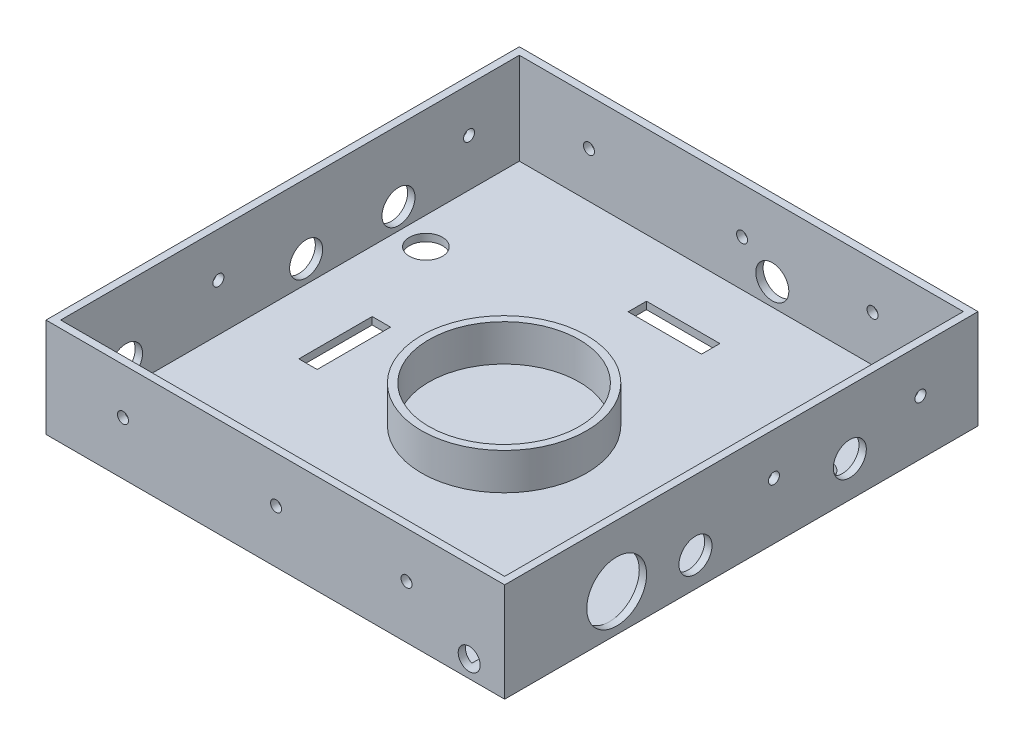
ISO-10303-21;
HEADER;
FILE_DESCRIPTION(('STEP AP214'),'2;1');
FILE_NAME('part.step','',(''),(''),'','','');
FILE_SCHEMA(('AUTOMOTIVE_DESIGN { 1 0 10303 214 1 1 1 1 }'));
ENDSEC;
DATA;
#1=APPLICATION_CONTEXT('core data for automotive mechanical design processes');
#2=APPLICATION_PROTOCOL_DEFINITION('international standard','automotive_design',2000,#1);
#3=PRODUCT_CONTEXT('',#1,'mechanical');
#4=PRODUCT('Part','Part','',(#3));
#5=PRODUCT_RELATED_PRODUCT_CATEGORY('part','',(#4));
#6=PRODUCT_DEFINITION_FORMATION('','',#4);
#7=PRODUCT_DEFINITION_CONTEXT('part definition',#1,'design');
#8=PRODUCT_DEFINITION('design','',#6,#7);
#9=PRODUCT_DEFINITION_SHAPE('','',#8);
#10=(LENGTH_UNIT() NAMED_UNIT(*) SI_UNIT(.MILLI.,.METRE.));
#11=(NAMED_UNIT(*) PLANE_ANGLE_UNIT() SI_UNIT($,.RADIAN.));
#12=(NAMED_UNIT(*) SI_UNIT($,.STERADIAN.) SOLID_ANGLE_UNIT());
#13=UNCERTAINTY_MEASURE_WITH_UNIT(LENGTH_MEASURE(1.E-05),#10,'distance_accuracy_value','');
#14=(GEOMETRIC_REPRESENTATION_CONTEXT(3) GLOBAL_UNCERTAINTY_ASSIGNED_CONTEXT((#13)) GLOBAL_UNIT_ASSIGNED_CONTEXT((#10,
#11,#12)) REPRESENTATION_CONTEXT('',''));
#15=CARTESIAN_POINT('',(0.,0.,0.));
#16=DIRECTION('',(0.,0.,1.));
#17=DIRECTION('',(1.,0.,0.));
#18=AXIS2_PLACEMENT_3D('',#15,#16,#17);
#19=CARTESIAN_POINT('',(0.,2.,0.));
#20=DIRECTION('',(0.,-1.,0.));
#21=DIRECTION('',(0.,0.,-1.));
#22=AXIS2_PLACEMENT_3D('',#19,#20,#21);
#23=PLANE('',#22);
#24=DIRECTION('',(1.,0.,0.));
#25=VECTOR('',#24,1.);
#26=CARTESIAN_POINT('',(46.9593553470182,2.,3.77541604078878));
#27=LINE('',#26,#25);
#28=CARTESIAN_POINT('',(46.9593553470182,2.,3.77541604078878));
#29=VERTEX_POINT('',#28);
#30=CARTESIAN_POINT('',(51.9593553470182,2.,3.77541604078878));
#31=VERTEX_POINT('',#30);
#32=EDGE_CURVE('E212',#29,#31,#27,.T.);
#33=ORIENTED_EDGE('',*,*,#32,.F.);
#34=DIRECTION('',(0.,0.,1.));
#35=VECTOR('',#34,1.);
#36=CARTESIAN_POINT('',(46.9593553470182,2.,-16.2245839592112));
#37=LINE('',#36,#35);
#38=CARTESIAN_POINT('',(46.9593553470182,2.,-16.2245839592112));
#39=VERTEX_POINT('',#38);
#40=EDGE_CURVE('E65',#39,#29,#37,.T.);
#41=ORIENTED_EDGE('',*,*,#40,.F.);
#42=DIRECTION('',(1.,0.,0.));
#43=VECTOR('',#42,1.);
#44=CARTESIAN_POINT('',(46.9593553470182,2.,-16.2245839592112));
#45=LINE('',#44,#43);
#46=CARTESIAN_POINT('',(51.9593553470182,2.,-16.2245839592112));
#47=VERTEX_POINT('',#46);
#48=EDGE_CURVE('E219',#39,#47,#45,.T.);
#49=ORIENTED_EDGE('',*,*,#48,.T.);
#50=DIRECTION('',(0.,0.,1.));
#51=VECTOR('',#50,1.);
#52=CARTESIAN_POINT('',(51.9593553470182,2.,-16.2245839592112));
#53=LINE('',#52,#51);
#54=EDGE_CURVE('E216',#47,#31,#53,.T.);
#55=ORIENTED_EDGE('',*,*,#54,.T.);
#56=EDGE_LOOP('',(#33,#41,#49,#55));
#57=FACE_BOUND('',#56,.T.);
#58=DIRECTION('',(0.,0.,1.));
#59=VECTOR('',#58,1.);
#60=CARTESIAN_POINT('',(-31.3843285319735,2.,-15.2814863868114));
#61=LINE('',#60,#59);
#62=CARTESIAN_POINT('',(-31.3843285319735,2.,-15.2814863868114));
#63=VERTEX_POINT('',#62);
#64=CARTESIAN_POINT('',(-31.3843285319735,2.,4.71851361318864));
#65=VERTEX_POINT('',#64);
#66=EDGE_CURVE('E245',#63,#65,#61,.T.);
#67=ORIENTED_EDGE('',*,*,#66,.T.);
#68=DIRECTION('',(1.,0.,0.));
#69=VECTOR('',#68,1.);
#70=CARTESIAN_POINT('',(-36.3843285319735,2.,4.71851361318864));
#71=LINE('',#70,#69);
#72=CARTESIAN_POINT('',(-36.3843285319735,2.,4.71851361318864));
#73=VERTEX_POINT('',#72);
#74=EDGE_CURVE('E213',#73,#65,#71,.T.);
#75=ORIENTED_EDGE('',*,*,#74,.F.);
#76=DIRECTION('',(0.,0.,1.));
#77=VECTOR('',#76,1.);
#78=CARTESIAN_POINT('',(-36.3843285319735,2.,-15.2814863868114));
#79=LINE('',#78,#77);
#80=CARTESIAN_POINT('',(-36.3843285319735,2.,-15.2814863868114));
#81=VERTEX_POINT('',#80);
#82=EDGE_CURVE('E234',#81,#73,#79,.T.);
#83=ORIENTED_EDGE('',*,*,#82,.F.);
#84=DIRECTION('',(1.,0.,0.));
#85=VECTOR('',#84,1.);
#86=CARTESIAN_POINT('',(-36.3843285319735,2.,-15.2814863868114));
#87=LINE('',#86,#85);
#88=EDGE_CURVE('E242',#81,#63,#87,.T.);
#89=ORIENTED_EDGE('',*,*,#88,.T.);
#90=EDGE_LOOP('',(#67,#75,#83,#89));
#91=FACE_BOUND('',#90,.T.);
#92=DIRECTION('',(1.,0.,0.));
#93=VECTOR('',#92,1.);
#94=CARTESIAN_POINT('',(-2.62338511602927,2.,-51.2737608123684));
#95=LINE('',#94,#93);
#96=CARTESIAN_POINT('',(-2.62338511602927,2.,-51.2737608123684));
#97=VERTEX_POINT('',#96);
#98=CARTESIAN_POINT('',(17.3766148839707,2.,-51.2737608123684));
#99=VERTEX_POINT('',#98);
#100=EDGE_CURVE('E310',#97,#99,#95,.T.);
#101=ORIENTED_EDGE('',*,*,#100,.F.);
#102=DIRECTION('',(0.,0.,1.));
#103=VECTOR('',#102,1.);
#104=CARTESIAN_POINT('',(-2.62338511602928,2.,-56.2737608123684));
#105=LINE('',#104,#103);
#106=CARTESIAN_POINT('',(-2.62338511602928,2.,-56.2737608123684));
#107=VERTEX_POINT('',#106);
#108=EDGE_CURVE('E308',#107,#97,#105,.T.);
#109=ORIENTED_EDGE('',*,*,#108,.F.);
#110=DIRECTION('',(-1.,0.,0.));
#111=VECTOR('',#110,1.);
#112=CARTESIAN_POINT('',(-2.62338511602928,2.,-56.2737608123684));
#113=LINE('',#112,#111);
#114=CARTESIAN_POINT('',(17.3766148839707,2.,-56.2737608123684));
#115=VERTEX_POINT('',#114);
#116=EDGE_CURVE('E316',#115,#107,#113,.T.);
#117=ORIENTED_EDGE('',*,*,#116,.F.);
#118=DIRECTION('',(0.,0.,-1.));
#119=VECTOR('',#118,1.);
#120=CARTESIAN_POINT('',(17.3766148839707,2.,-56.2737608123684));
#121=LINE('',#120,#119);
#122=EDGE_CURVE('E313',#99,#115,#121,.T.);
#123=ORIENTED_EDGE('',*,*,#122,.F.);
#124=EDGE_LOOP('',(#101,#109,#117,#123));
#125=FACE_BOUND('',#124,.T.);
#126=CARTESIAN_POINT('',(60.1353353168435,2.,-39.0517685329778));
#127=DIRECTION('',(0.,-1.,0.));
#128=DIRECTION('',(0.,0.,-1.));
#129=AXIS2_PLACEMENT_3D('',#126,#127,#128);
#130=CIRCLE('',#129,4.5);
#131=CARTESIAN_POINT('',(60.1353353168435,2.,-43.5517685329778));
#132=VERTEX_POINT('',#131);
#133=EDGE_CURVE('E337',#132,#132,#130,.T.);
#134=ORIENTED_EDGE('',*,*,#133,.T.);
#135=EDGE_LOOP('',(#134));
#136=FACE_BOUND('',#135,.T.);
#137=CARTESIAN_POINT('',(-45.5254811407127,2.,-39.0672089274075));
#138=DIRECTION('',(0.,-1.,0.));
#139=DIRECTION('',(0.,0.,-1.));
#140=AXIS2_PLACEMENT_3D('',#137,#138,#139);
#141=CIRCLE('',#140,4.5);
#142=CARTESIAN_POINT('',(-45.5254811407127,2.,-43.5672089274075));
#143=VERTEX_POINT('',#142);
#144=EDGE_CURVE('E332',#143,#143,#141,.T.);
#145=ORIENTED_EDGE('',*,*,#144,.T.);
#146=EDGE_LOOP('',(#145));
#147=FACE_BOUND('',#146,.T.);
#148=DIRECTION('',(-1.,0.,0.));
#149=VECTOR('',#148,1.);
#150=CARTESIAN_POINT('',(0.,2.,45.0000000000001));
#151=LINE('',#150,#149);
#152=CARTESIAN_POINT('',(61.6542783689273,2.,45.0000000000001));
#153=VERTEX_POINT('',#152);
#154=CARTESIAN_POINT('',(59.0164717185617,2.,45.0000000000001));
#155=VERTEX_POINT('',#154);
#156=EDGE_CURVE('E11',#153,#155,#151,.T.);
#157=ORIENTED_EDGE('',*,*,#156,.F.);
#158=DIRECTION('',(0.,0.,1.));
#159=VECTOR('',#158,1.);
#160=CARTESIAN_POINT('',(61.6542783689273,2.,45.0000000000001));
#161=LINE('',#160,#159);
#162=CARTESIAN_POINT('',(61.6542783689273,2.,53.));
#163=VERTEX_POINT('',#162);
#164=EDGE_CURVE('E197',#153,#163,#161,.T.);
#165=ORIENTED_EDGE('',*,*,#164,.T.);
#166=DIRECTION('',(1.,0.,0.));
#167=VECTOR('',#166,1.);
#168=CARTESIAN_POINT('',(0.,2.,53.));
#169=LINE('',#168,#167);
#170=CARTESIAN_POINT('',(68.,2.,53.));
#171=VERTEX_POINT('',#170);
#172=EDGE_CURVE('E408',#163,#171,#169,.T.);
#173=ORIENTED_EDGE('',*,*,#172,.T.);
#174=DIRECTION('',(0.,0.,-1.));
#175=VECTOR('',#174,1.);
#176=CARTESIAN_POINT('',(68.,2.,0.));
#177=LINE('',#176,#175);
#178=CARTESIAN_POINT('',(68.,2.,-72.));
#179=VERTEX_POINT('',#178);
#180=EDGE_CURVE('E382',#171,#179,#177,.T.);
#181=ORIENTED_EDGE('',*,*,#180,.T.);
#182=DIRECTION('',(1.,0.,0.));
#183=VECTOR('',#182,1.);
#184=CARTESIAN_POINT('',(0.,2.,-72.));
#185=LINE('',#184,#183);
#186=CARTESIAN_POINT('',(-53.,2.,-72.));
#187=VERTEX_POINT('',#186);
#188=EDGE_CURVE('E387',#187,#179,#185,.T.);
#189=ORIENTED_EDGE('',*,*,#188,.F.);
#190=DIRECTION('',(0.,0.,-1.));
#191=VECTOR('',#190,1.);
#192=CARTESIAN_POINT('',(-53.,2.,0.));
#193=LINE('',#192,#191);
#194=CARTESIAN_POINT('',(-53.,2.,53.));
#195=VERTEX_POINT('',#194);
#196=EDGE_CURVE('E410',#195,#187,#193,.T.);
#197=ORIENTED_EDGE('',*,*,#196,.F.);
#198=CARTESIAN_POINT('',(59.0164717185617,2.,53.));
#199=VERTEX_POINT('',#198);
#200=EDGE_CURVE('E204',#195,#199,#169,.T.);
#201=ORIENTED_EDGE('',*,*,#200,.T.);
#202=DIRECTION('',(0.,0.,1.));
#203=VECTOR('',#202,1.);
#204=CARTESIAN_POINT('',(59.0164717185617,2.,45.0000000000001));
#205=LINE('',#204,#203);
#206=EDGE_CURVE('E57',#199,#155,#205,.F.);
#207=ORIENTED_EDGE('',*,*,#206,.T.);
#208=EDGE_LOOP('',(#157,#165,#173,#181,#189,#197,#201,#207));
#209=FACE_BOUND('',#208,.T.);
#210=CARTESIAN_POINT('',(7.29746461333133,2.,-7.54756443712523));
#211=DIRECTION('',(0.,1.,0.));
#212=DIRECTION('',(0.,0.,1.));
#213=AXIS2_PLACEMENT_3D('',#210,#211,#212);
#214=CIRCLE('',#213,22.5);
#215=CARTESIAN_POINT('',(7.29746461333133,2.,14.9524355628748));
#216=VERTEX_POINT('',#215);
#217=EDGE_CURVE('E436',#216,#216,#214,.T.);
#218=ORIENTED_EDGE('',*,*,#217,.F.);
#219=EDGE_LOOP('',(#218));
#220=FACE_BOUND('',#219,.T.);
#221=ADVANCED_FACE('F42',(#57,#91,#125,#136,#147,#209,#220),#23,.F.);
#222=CARTESIAN_POINT('',(7.29746461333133,12.,-7.54756443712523));
#223=DIRECTION('',(0.,-1.,0.));
#224=DIRECTION('',(0.,0.,-1.));
#225=AXIS2_PLACEMENT_3D('',#222,#223,#224);
#226=CYLINDRICAL_SURFACE('',#225,22.5);
#227=CARTESIAN_POINT('',(7.29746461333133,12.,-7.54756443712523));
#228=DIRECTION('',(0.,1.,0.));
#229=DIRECTION('',(0.,0.,1.));
#230=AXIS2_PLACEMENT_3D('',#227,#228,#229);
#231=CIRCLE('',#230,22.5);
#232=CARTESIAN_POINT('',(7.29746461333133,12.,14.9524355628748));
#233=VERTEX_POINT('',#232);
#234=EDGE_CURVE('E430',#233,#233,#231,.T.);
#235=ORIENTED_EDGE('',*,*,#234,.F.);
#236=EDGE_LOOP('',(#235));
#237=FACE_BOUND('',#236,.T.);
#238=ORIENTED_EDGE('',*,*,#217,.T.);
#239=EDGE_LOOP('',(#238));
#240=FACE_BOUND('',#239,.T.);
#241=ADVANCED_FACE('F511',(#237,#240),#226,.T.);
#242=CARTESIAN_POINT('',(7.29746461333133,12.,-7.54756443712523));
#243=DIRECTION('',(0.,1.,0.));
#244=DIRECTION('',(0.,0.,1.));
#245=AXIS2_PLACEMENT_3D('',#242,#243,#244);
#246=PLANE('',#245);
#247=CARTESIAN_POINT('',(7.29746461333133,12.,-7.54756443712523));
#248=DIRECTION('',(0.,1.,0.));
#249=DIRECTION('',(0.,0.,1.));
#250=AXIS2_PLACEMENT_3D('',#247,#248,#249);
#251=CIRCLE('',#250,20.5);
#252=CARTESIAN_POINT('',(7.29746461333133,12.,12.9524355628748));
#253=VERTEX_POINT('',#252);
#254=EDGE_CURVE('E426',#253,#253,#251,.T.);
#255=ORIENTED_EDGE('',*,*,#254,.F.);
#256=EDGE_LOOP('',(#255));
#257=FACE_BOUND('',#256,.T.);
#258=ORIENTED_EDGE('',*,*,#234,.T.);
#259=EDGE_LOOP('',(#258));
#260=FACE_BOUND('',#259,.T.);
#261=ADVANCED_FACE('F516',(#257,#260),#246,.T.);
#262=CARTESIAN_POINT('',(7.29746461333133,2.,-7.54756443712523));
#263=DIRECTION('',(0.,1.,0.));
#264=DIRECTION('',(0.,0.,1.));
#265=AXIS2_PLACEMENT_3D('',#262,#263,#264);
#266=CYLINDRICAL_SURFACE('',#265,20.5);
#267=CARTESIAN_POINT('',(7.29746461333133,2.,-7.54756443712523));
#268=DIRECTION('',(0.,1.,0.));
#269=DIRECTION('',(0.,0.,1.));
#270=AXIS2_PLACEMENT_3D('',#267,#268,#269);
#271=CIRCLE('',#270,20.5);
#272=CARTESIAN_POINT('',(7.29746461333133,2.,12.9524355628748));
#273=VERTEX_POINT('',#272);
#274=EDGE_CURVE('E427',#273,#273,#271,.T.);
#275=ORIENTED_EDGE('',*,*,#274,.F.);
#276=EDGE_LOOP('',(#275));
#277=FACE_BOUND('',#276,.T.);
#278=ORIENTED_EDGE('',*,*,#254,.T.);
#279=EDGE_LOOP('',(#278));
#280=FACE_BOUND('',#279,.T.);
#281=ADVANCED_FACE('F539',(#277,#280),#266,.F.);
#282=CARTESIAN_POINT('',(7.29746461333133,2.,-7.54756443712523));
#283=DIRECTION('',(0.,1.,0.));
#284=DIRECTION('',(0.,0.,1.));
#285=AXIS2_PLACEMENT_3D('',#282,#283,#284);
#286=PLANE('',#285);
#287=ORIENTED_EDGE('',*,*,#274,.T.);
#288=EDGE_LOOP('',(#287));
#289=FACE_BOUND('',#288,.T.);
#290=ADVANCED_FACE('F543',(#289),#286,.T.);
#291=CARTESIAN_POINT('',(68.,27.,0.));
#292=DIRECTION('',(-1.,0.,0.));
#293=DIRECTION('',(0.,0.,1.));
#294=AXIS2_PLACEMENT_3D('',#291,#292,#293);
#295=PLANE('',#294);
#296=CARTESIAN_POINT('',(68.,15.4757337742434,-18.3932276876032));
#297=DIRECTION('',(-1.,0.,0.));
#298=DIRECTION('',(0.,0.,1.));
#299=AXIS2_PLACEMENT_3D('',#296,#297,#298);
#300=CIRCLE('',#299,1.5);
#301=CARTESIAN_POINT('',(68.,15.4757337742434,-16.8932276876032));
#302=VERTEX_POINT('',#301);
#303=EDGE_CURVE('E257',#302,#302,#300,.T.);
#304=ORIENTED_EDGE('',*,*,#303,.F.);
#305=EDGE_LOOP('',(#304));
#306=FACE_BOUND('',#305,.T.);
#307=CARTESIAN_POINT('',(68.,14.9116897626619,-58.30430198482));
#308=DIRECTION('',(-1.,0.,0.));
#309=DIRECTION('',(0.,0.,1.));
#310=AXIS2_PLACEMENT_3D('',#307,#308,#309);
#311=CIRCLE('',#310,1.5);
#312=CARTESIAN_POINT('',(68.,14.9116897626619,-56.80430198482));
#313=VERTEX_POINT('',#312);
#314=EDGE_CURVE('E252',#313,#313,#311,.T.);
#315=ORIENTED_EDGE('',*,*,#314,.F.);
#316=EDGE_LOOP('',(#315));
#317=FACE_BOUND('',#316,.T.);
#318=CARTESIAN_POINT('',(68.,10.1812686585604,24.4688830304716));
#319=DIRECTION('',(-1.,0.,0.));
#320=DIRECTION('',(0.,0.,1.));
#321=AXIS2_PLACEMENT_3D('',#318,#319,#320);
#322=CIRCLE('',#321,8.15399104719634);
#323=CARTESIAN_POINT('',(68.,10.1812686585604,16.3148919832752));
#324=VERTEX_POINT('',#323);
#325=EDGE_CURVE('E379',#324,#324,#322,.T.);
#326=ORIENTED_EDGE('',*,*,#325,.F.);
#327=EDGE_LOOP('',(#326));
#328=FACE_BOUND('',#327,.T.);
#329=CARTESIAN_POINT('',(68.,8.00000000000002,2.9904997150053));
#330=DIRECTION('',(-1.,0.,0.));
#331=DIRECTION('',(0.,0.,1.));
#332=AXIS2_PLACEMENT_3D('',#329,#330,#331);
#333=CIRCLE('',#332,4.5);
#334=CARTESIAN_POINT('',(68.,8.00000000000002,-1.5095002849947));
#335=VERTEX_POINT('',#334);
#336=EDGE_CURVE('E376',#335,#335,#333,.T.);
#337=ORIENTED_EDGE('',*,*,#336,.F.);
#338=EDGE_LOOP('',(#337));
#339=FACE_BOUND('',#338,.T.);
#340=CARTESIAN_POINT('',(68.,9.75138176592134,-39.0672089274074));
#341=DIRECTION('',(-1.,0.,0.));
#342=DIRECTION('',(0.,0.,1.));
#343=AXIS2_PLACEMENT_3D('',#340,#341,#342);
#344=CIRCLE('',#343,4.5);
#345=CARTESIAN_POINT('',(68.,9.75138176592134,-43.5672089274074));
#346=VERTEX_POINT('',#345);
#347=EDGE_CURVE('E368',#346,#346,#344,.T.);
#348=ORIENTED_EDGE('',*,*,#347,.F.);
#349=EDGE_LOOP('',(#348));
#350=FACE_BOUND('',#349,.T.);
#351=ORIENTED_EDGE('',*,*,#180,.F.);
#352=DIRECTION('',(0.,-1.,0.));
#353=VECTOR('',#352,1.);
#354=CARTESIAN_POINT('',(68.,27.,53.));
#355=LINE('',#354,#353);
#356=CARTESIAN_POINT('',(68.,27.,53.));
#357=VERTEX_POINT('',#356);
#358=EDGE_CURVE('E423',#357,#171,#355,.T.);
#359=ORIENTED_EDGE('',*,*,#358,.F.);
#360=DIRECTION('',(0.,0.,-1.));
#361=VECTOR('',#360,1.);
#362=CARTESIAN_POINT('',(68.,27.,0.));
#363=LINE('',#362,#361);
#364=CARTESIAN_POINT('',(68.,27.,-72.));
#365=VERTEX_POINT('',#364);
#366=EDGE_CURVE('E383',#357,#365,#363,.T.);
#367=ORIENTED_EDGE('',*,*,#366,.T.);
#368=DIRECTION('',(0.,-1.,0.));
#369=VECTOR('',#368,1.);
#370=CARTESIAN_POINT('',(68.,27.,-72.));
#371=LINE('',#370,#369);
#372=EDGE_CURVE('E406',#365,#179,#371,.T.);
#373=ORIENTED_EDGE('',*,*,#372,.T.);
#374=EDGE_LOOP('',(#351,#359,#367,#373));
#375=FACE_BOUND('',#374,.T.);
#376=ADVANCED_FACE('F547',(#306,#317,#328,#339,#350,#375),#295,.T.);
#377=CARTESIAN_POINT('',(0.,27.,53.));
#378=DIRECTION('',(0.,0.,-1.));
#379=DIRECTION('',(-1.,0.,0.));
#380=AXIS2_PLACEMENT_3D('',#377,#378,#379);
#381=PLANE('',#380);
#382=CARTESIAN_POINT('',(60.3353750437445,4.6945303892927,53.));
#383=DIRECTION('',(0.,0.,-1.));
#384=DIRECTION('',(-1.,0.,0.));
#385=AXIS2_PLACEMENT_3D('',#382,#383,#384);
#386=CIRCLE('',#385,3.00000000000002);
#387=EDGE_CURVE('E198',#199,#163,#386,.T.);
#388=ORIENTED_EDGE('',*,*,#387,.F.);
#389=ORIENTED_EDGE('',*,*,#200,.F.);
#390=DIRECTION('',(0.,-1.,0.));
#391=VECTOR('',#390,1.);
#392=CARTESIAN_POINT('',(-53.,27.,53.));
#393=LINE('',#392,#391);
#394=CARTESIAN_POINT('',(-53.,27.,53.));
#395=VERTEX_POINT('',#394);
#396=EDGE_CURVE('E420',#395,#195,#393,.T.);
#397=ORIENTED_EDGE('',*,*,#396,.F.);
#398=DIRECTION('',(1.,0.,0.));
#399=VECTOR('',#398,1.);
#400=CARTESIAN_POINT('',(0.,27.,53.));
#401=LINE('',#400,#399);
#402=EDGE_CURVE('E386',#395,#357,#401,.T.);
#403=ORIENTED_EDGE('',*,*,#402,.T.);
#404=ORIENTED_EDGE('',*,*,#358,.T.);
#405=ORIENTED_EDGE('',*,*,#172,.F.);
#406=EDGE_LOOP('',(#388,#389,#397,#403,#404,#405));
#407=FACE_BOUND('',#406,.T.);
#408=CARTESIAN_POINT('',(43.2593185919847,14.4581214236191,53.));
#409=DIRECTION('',(0.,0.,-1.));
#410=DIRECTION('',(-1.,0.,0.));
#411=AXIS2_PLACEMENT_3D('',#408,#409,#410);
#412=CIRCLE('',#411,1.5);
#413=CARTESIAN_POINT('',(41.7593185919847,14.4581214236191,53.));
#414=VERTEX_POINT('',#413);
#415=EDGE_CURVE('E305',#414,#414,#412,.T.);
#416=ORIENTED_EDGE('',*,*,#415,.F.);
#417=EDGE_LOOP('',(#416));
#418=FACE_BOUND('',#417,.T.);
#419=CARTESIAN_POINT('',(-34.018321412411,14.4581214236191,53.));
#420=DIRECTION('',(0.,0.,-1.));
#421=DIRECTION('',(-1.,0.,0.));
#422=AXIS2_PLACEMENT_3D('',#419,#420,#421);
#423=CIRCLE('',#422,1.5);
#424=CARTESIAN_POINT('',(-35.518321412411,14.4581214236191,53.));
#425=VERTEX_POINT('',#424);
#426=EDGE_CURVE('E296',#425,#425,#423,.T.);
#427=ORIENTED_EDGE('',*,*,#426,.F.);
#428=EDGE_LOOP('',(#427));
#429=FACE_BOUND('',#428,.T.);
#430=CARTESIAN_POINT('',(7.70003972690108,14.4581214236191,53.));
#431=DIRECTION('',(0.,0.,-1.));
#432=DIRECTION('',(-1.,0.,0.));
#433=AXIS2_PLACEMENT_3D('',#430,#431,#432);
#434=CIRCLE('',#433,1.5);
#435=CARTESIAN_POINT('',(6.20003972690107,14.4581214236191,53.));
#436=VERTEX_POINT('',#435);
#437=EDGE_CURVE('E287',#436,#436,#434,.T.);
#438=ORIENTED_EDGE('',*,*,#437,.F.);
#439=EDGE_LOOP('',(#438));
#440=FACE_BOUND('',#439,.T.);
#441=ADVANCED_FACE('F551',(#407,#418,#429,#440),#381,.T.);
#442=CARTESIAN_POINT('',(-53.,27.,0.));
#443=DIRECTION('',(-1.,0.,0.));
#444=DIRECTION('',(0.,0.,1.));
#445=AXIS2_PLACEMENT_3D('',#442,#443,#444);
#446=PLANE('',#445);
#447=CARTESIAN_POINT('',(-53.,14.9116897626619,-58.30430198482));
#448=DIRECTION('',(-1.,0.,0.));
#449=DIRECTION('',(0.,0.,1.));
#450=AXIS2_PLACEMENT_3D('',#447,#448,#449);
#451=CIRCLE('',#450,1.5);
#452=CARTESIAN_POINT('',(-53.,14.9116897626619,-56.80430198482));
#453=VERTEX_POINT('',#452);
#454=EDGE_CURVE('E269',#453,#453,#451,.T.);
#455=ORIENTED_EDGE('',*,*,#454,.T.);
#456=EDGE_LOOP('',(#455));
#457=FACE_BOUND('',#456,.T.);
#458=CARTESIAN_POINT('',(-53.,14.9116897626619,10.0090437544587));
#459=DIRECTION('',(-1.,0.,0.));
#460=DIRECTION('',(0.,0.,1.));
#461=AXIS2_PLACEMENT_3D('',#458,#459,#460);
#462=CIRCLE('',#461,1.5);
#463=CARTESIAN_POINT('',(-53.,14.9116897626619,11.5090437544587));
#464=VERTEX_POINT('',#463);
#465=EDGE_CURVE('E264',#464,#464,#462,.T.);
#466=ORIENTED_EDGE('',*,*,#465,.T.);
#467=EDGE_LOOP('',(#466));
#468=FACE_BOUND('',#467,.T.);
#469=CARTESIAN_POINT('',(-53.,8.02196504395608,35.1902788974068));
#470=DIRECTION('',(-1.,0.,0.));
#471=DIRECTION('',(0.,0.,1.));
#472=AXIS2_PLACEMENT_3D('',#469,#470,#471);
#473=CIRCLE('',#472,4.5);
#474=CARTESIAN_POINT('',(-53.,8.02196504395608,39.6902788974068));
#475=VERTEX_POINT('',#474);
#476=EDGE_CURVE('E361',#475,#475,#473,.T.);
#477=ORIENTED_EDGE('',*,*,#476,.T.);
#478=EDGE_LOOP('',(#477));
#479=FACE_BOUND('',#478,.T.);
#480=CARTESIAN_POINT('',(-53.,8.,-13.8932276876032));
#481=DIRECTION('',(-1.,0.,0.));
#482=DIRECTION('',(0.,0.,1.));
#483=AXIS2_PLACEMENT_3D('',#480,#481,#482);
#484=CIRCLE('',#483,4.5);
#485=CARTESIAN_POINT('',(-53.,8.,-9.39322768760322));
#486=VERTEX_POINT('',#485);
#487=EDGE_CURVE('E358',#486,#486,#484,.T.);
#488=ORIENTED_EDGE('',*,*,#487,.T.);
#489=EDGE_LOOP('',(#488));
#490=FACE_BOUND('',#489,.T.);
#491=CARTESIAN_POINT('',(-53.,7.75138176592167,-39.0672089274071));
#492=DIRECTION('',(-1.,0.,0.));
#493=DIRECTION('',(0.,0.,1.));
#494=AXIS2_PLACEMENT_3D('',#491,#492,#493);
#495=CIRCLE('',#494,4.5);
#496=CARTESIAN_POINT('',(-53.,7.75138176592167,-34.5672089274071));
#497=VERTEX_POINT('',#496);
#498=EDGE_CURVE('E350',#497,#497,#495,.T.);
#499=ORIENTED_EDGE('',*,*,#498,.T.);
#500=EDGE_LOOP('',(#499));
#501=FACE_BOUND('',#500,.T.);
#502=ORIENTED_EDGE('',*,*,#196,.T.);
#503=DIRECTION('',(0.,-1.,0.));
#504=VECTOR('',#503,1.);
#505=CARTESIAN_POINT('',(-53.,27.,-72.));
#506=LINE('',#505,#504);
#507=CARTESIAN_POINT('',(-53.,27.,-72.));
#508=VERTEX_POINT('',#507);
#509=EDGE_CURVE('E417',#508,#187,#506,.T.);
#510=ORIENTED_EDGE('',*,*,#509,.F.);
#511=DIRECTION('',(0.,0.,-1.));
#512=VECTOR('',#511,1.);
#513=CARTESIAN_POINT('',(-53.,27.,0.));
#514=LINE('',#513,#512);
#515=EDGE_CURVE('E390',#395,#508,#514,.T.);
#516=ORIENTED_EDGE('',*,*,#515,.F.);
#517=ORIENTED_EDGE('',*,*,#396,.T.);
#518=EDGE_LOOP('',(#502,#510,#516,#517));
#519=FACE_BOUND('',#518,.T.);
#520=ADVANCED_FACE('F554',(#457,#468,#479,#490,#501,#519),#446,.F.);
#521=CARTESIAN_POINT('',(0.,27.,-72.));
#522=DIRECTION('',(0.,0.,-1.));
#523=DIRECTION('',(-1.,0.,0.));
#524=AXIS2_PLACEMENT_3D('',#521,#522,#523);
#525=PLANE('',#524);
#526=CARTESIAN_POINT('',(43.2593185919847,14.4581214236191,-72.));
#527=DIRECTION('',(0.,0.,-1.));
#528=DIRECTION('',(-1.,0.,0.));
#529=AXIS2_PLACEMENT_3D('',#526,#527,#528);
#530=CIRCLE('',#529,1.5);
#531=CARTESIAN_POINT('',(41.7593185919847,14.4581214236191,-72.));
#532=VERTEX_POINT('',#531);
#533=EDGE_CURVE('E302',#532,#532,#530,.T.);
#534=ORIENTED_EDGE('',*,*,#533,.T.);
#535=EDGE_LOOP('',(#534));
#536=FACE_BOUND('',#535,.T.);
#537=CARTESIAN_POINT('',(-34.018321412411,14.4581214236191,-72.));
#538=DIRECTION('',(0.,0.,-1.));
#539=DIRECTION('',(-1.,0.,0.));
#540=AXIS2_PLACEMENT_3D('',#537,#538,#539);
#541=CIRCLE('',#540,1.5);
#542=CARTESIAN_POINT('',(-35.518321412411,14.4581214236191,-72.));
#543=VERTEX_POINT('',#542);
#544=EDGE_CURVE('E293',#543,#543,#541,.T.);
#545=ORIENTED_EDGE('',*,*,#544,.T.);
#546=EDGE_LOOP('',(#545));
#547=FACE_BOUND('',#546,.T.);
#548=CARTESIAN_POINT('',(7.70003972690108,14.4581214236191,-72.));
#549=DIRECTION('',(0.,0.,-1.));
#550=DIRECTION('',(-1.,0.,0.));
#551=AXIS2_PLACEMENT_3D('',#548,#549,#550);
#552=CIRCLE('',#551,1.5);
#553=CARTESIAN_POINT('',(6.20003972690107,14.4581214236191,-72.));
#554=VERTEX_POINT('',#553);
#555=EDGE_CURVE('E284',#554,#554,#552,.T.);
#556=ORIENTED_EDGE('',*,*,#555,.T.);
#557=EDGE_LOOP('',(#556));
#558=FACE_BOUND('',#557,.T.);
#559=CARTESIAN_POINT('',(15.9382483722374,8.,-72.));
#560=DIRECTION('',(0.,0.,-1.));
#561=DIRECTION('',(-1.,0.,0.));
#562=AXIS2_PLACEMENT_3D('',#559,#560,#561);
#563=CIRCLE('',#562,4.5);
#564=CARTESIAN_POINT('',(11.4382483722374,8.,-72.));
#565=VERTEX_POINT('',#564);
#566=EDGE_CURVE('E343',#565,#565,#563,.T.);
#567=ORIENTED_EDGE('',*,*,#566,.T.);
#568=EDGE_LOOP('',(#567));
#569=FACE_BOUND('',#568,.T.);
#570=ORIENTED_EDGE('',*,*,#188,.T.);
#571=ORIENTED_EDGE('',*,*,#372,.F.);
#572=DIRECTION('',(1.,0.,0.));
#573=VECTOR('',#572,1.);
#574=CARTESIAN_POINT('',(0.,27.,-72.));
#575=LINE('',#574,#573);
#576=EDGE_CURVE('E392',#508,#365,#575,.T.);
#577=ORIENTED_EDGE('',*,*,#576,.F.);
#578=ORIENTED_EDGE('',*,*,#509,.T.);
#579=EDGE_LOOP('',(#570,#571,#577,#578));
#580=FACE_BOUND('',#579,.T.);
#581=ADVANCED_FACE('F558',(#536,#547,#558,#569,#580),#525,.F.);
#582=CARTESIAN_POINT('',(0.,27.,0.));
#583=DIRECTION('',(0.,1.,0.));
#584=DIRECTION('',(0.,0.,1.));
#585=AXIS2_PLACEMENT_3D('',#582,#583,#584);
#586=PLANE('',#585);
#587=ORIENTED_EDGE('',*,*,#366,.F.);
#588=ORIENTED_EDGE('',*,*,#402,.F.);
#589=ORIENTED_EDGE('',*,*,#515,.T.);
#590=ORIENTED_EDGE('',*,*,#576,.T.);
#591=EDGE_LOOP('',(#587,#588,#589,#590));
#592=FACE_BOUND('',#591,.T.);
#593=DIRECTION('',(0.,0.,-1.));
#594=VECTOR('',#593,1.);
#595=CARTESIAN_POINT('',(70.,27.,0.));
#596=LINE('',#595,#594);
#597=CARTESIAN_POINT('',(70.,27.,55.));
#598=VERTEX_POINT('',#597);
#599=CARTESIAN_POINT('',(70.,27.,-74.));
#600=VERTEX_POINT('',#599);
#601=EDGE_CURVE('E394',#598,#600,#596,.T.);
#602=ORIENTED_EDGE('',*,*,#601,.T.);
#603=DIRECTION('',(-1.,0.,0.));
#604=VECTOR('',#603,1.);
#605=CARTESIAN_POINT('',(0.,27.,-74.));
#606=LINE('',#605,#604);
#607=CARTESIAN_POINT('',(-55.,27.,-74.));
#608=VERTEX_POINT('',#607);
#609=EDGE_CURVE('E397',#600,#608,#606,.T.);
#610=ORIENTED_EDGE('',*,*,#609,.T.);
#611=DIRECTION('',(0.,0.,1.));
#612=VECTOR('',#611,1.);
#613=CARTESIAN_POINT('',(-55.,27.,0.));
#614=LINE('',#613,#612);
#615=CARTESIAN_POINT('',(-55.,27.,55.));
#616=VERTEX_POINT('',#615);
#617=EDGE_CURVE('E400',#608,#616,#614,.T.);
#618=ORIENTED_EDGE('',*,*,#617,.T.);
#619=DIRECTION('',(1.,0.,0.));
#620=VECTOR('',#619,1.);
#621=CARTESIAN_POINT('',(0.,27.,55.));
#622=LINE('',#621,#620);
#623=EDGE_CURVE('E403',#616,#598,#622,.T.);
#624=ORIENTED_EDGE('',*,*,#623,.T.);
#625=EDGE_LOOP('',(#602,#610,#618,#624));
#626=FACE_BOUND('',#625,.T.);
#627=ADVANCED_FACE('F562',(#592,#626),#586,.T.);
#628=CARTESIAN_POINT('',(0.,0.,0.));
#629=DIRECTION('',(0.,-1.,0.));
#630=DIRECTION('',(0.,0.,-1.));
#631=AXIS2_PLACEMENT_3D('',#628,#629,#630);
#632=PLANE('',#631);
#633=DIRECTION('',(0.,0.,-1.));
#634=VECTOR('',#633,1.);
#635=CARTESIAN_POINT('',(46.9593553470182,0.,0.));
#636=LINE('',#635,#634);
#637=CARTESIAN_POINT('',(46.9593553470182,0.,3.77541604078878));
#638=VERTEX_POINT('',#637);
#639=CARTESIAN_POINT('',(46.9593553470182,0.,-16.2245839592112));
#640=VERTEX_POINT('',#639);
#641=EDGE_CURVE('E50',#638,#640,#636,.T.);
#642=ORIENTED_EDGE('',*,*,#641,.F.);
#643=DIRECTION('',(-1.,0.,0.));
#644=VECTOR('',#643,1.);
#645=CARTESIAN_POINT('',(0.,0.,3.77541604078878));
#646=LINE('',#645,#644);
#647=CARTESIAN_POINT('',(51.9593553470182,0.,3.77541604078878));
#648=VERTEX_POINT('',#647);
#649=EDGE_CURVE('E475',#648,#638,#646,.T.);
#650=ORIENTED_EDGE('',*,*,#649,.F.);
#651=DIRECTION('',(0.,0.,-1.));
#652=VECTOR('',#651,1.);
#653=CARTESIAN_POINT('',(51.9593553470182,0.,0.));
#654=LINE('',#653,#652);
#655=CARTESIAN_POINT('',(51.9593553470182,0.,-16.2245839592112));
#656=VERTEX_POINT('',#655);
#657=EDGE_CURVE('E477',#648,#656,#654,.T.);
#658=ORIENTED_EDGE('',*,*,#657,.T.);
#659=DIRECTION('',(-1.,0.,0.));
#660=VECTOR('',#659,1.);
#661=CARTESIAN_POINT('',(0.,0.,-16.2245839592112));
#662=LINE('',#661,#660);
#663=EDGE_CURVE('E480',#656,#640,#662,.T.);
#664=ORIENTED_EDGE('',*,*,#663,.T.);
#665=EDGE_LOOP('',(#642,#650,#658,#664));
#666=FACE_BOUND('',#665,.T.);
#667=DIRECTION('',(-1.,0.,0.));
#668=VECTOR('',#667,1.);
#669=CARTESIAN_POINT('',(0.,0.,4.71851361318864));
#670=LINE('',#669,#668);
#671=CARTESIAN_POINT('',(-31.3843285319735,0.,4.71851361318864));
#672=VERTEX_POINT('',#671);
#673=CARTESIAN_POINT('',(-36.3843285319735,0.,4.71851361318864));
#674=VERTEX_POINT('',#673);
#675=EDGE_CURVE('E473',#672,#674,#670,.T.);
#676=ORIENTED_EDGE('',*,*,#675,.F.);
#677=DIRECTION('',(0.,0.,-1.));
#678=VECTOR('',#677,1.);
#679=CARTESIAN_POINT('',(-31.3843285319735,0.,0.));
#680=LINE('',#679,#678);
#681=CARTESIAN_POINT('',(-31.3843285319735,0.,-15.2814863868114));
#682=VERTEX_POINT('',#681);
#683=EDGE_CURVE('E465',#672,#682,#680,.T.);
#684=ORIENTED_EDGE('',*,*,#683,.T.);
#685=DIRECTION('',(-1.,0.,0.));
#686=VECTOR('',#685,1.);
#687=CARTESIAN_POINT('',(0.,0.,-15.2814863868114));
#688=LINE('',#687,#686);
#689=CARTESIAN_POINT('',(-36.3843285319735,0.,-15.2814863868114));
#690=VERTEX_POINT('',#689);
#691=EDGE_CURVE('E468',#682,#690,#688,.T.);
#692=ORIENTED_EDGE('',*,*,#691,.T.);
#693=DIRECTION('',(0.,0.,-1.));
#694=VECTOR('',#693,1.);
#695=CARTESIAN_POINT('',(-36.3843285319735,0.,0.));
#696=LINE('',#695,#694);
#697=EDGE_CURVE('E471',#674,#690,#696,.T.);
#698=ORIENTED_EDGE('',*,*,#697,.F.);
#699=EDGE_LOOP('',(#676,#684,#692,#698));
#700=FACE_BOUND('',#699,.T.);
#701=DIRECTION('',(0.,0.,-1.));
#702=VECTOR('',#701,1.);
#703=CARTESIAN_POINT('',(-2.62338511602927,0.,0.));
#704=LINE('',#703,#702);
#705=CARTESIAN_POINT('',(-2.62338511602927,0.,-51.2737608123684));
#706=VERTEX_POINT('',#705);
#707=CARTESIAN_POINT('',(-2.62338511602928,0.,-56.2737608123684));
#708=VERTEX_POINT('',#707);
#709=EDGE_CURVE('E463',#706,#708,#704,.T.);
#710=ORIENTED_EDGE('',*,*,#709,.F.);
#711=DIRECTION('',(-1.,0.,0.));
#712=VECTOR('',#711,1.);
#713=CARTESIAN_POINT('',(0.,0.,-51.2737608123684));
#714=LINE('',#713,#712);
#715=CARTESIAN_POINT('',(17.3766148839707,0.,-51.2737608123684));
#716=VERTEX_POINT('',#715);
#717=EDGE_CURVE('E439',#716,#706,#714,.T.);
#718=ORIENTED_EDGE('',*,*,#717,.F.);
#719=DIRECTION('',(0.,0.,1.));
#720=VECTOR('',#719,1.);
#721=CARTESIAN_POINT('',(17.3766148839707,0.,0.));
#722=LINE('',#721,#720);
#723=CARTESIAN_POINT('',(17.3766148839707,0.,-56.2737608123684));
#724=VERTEX_POINT('',#723);
#725=EDGE_CURVE('E458',#724,#716,#722,.T.);
#726=ORIENTED_EDGE('',*,*,#725,.F.);
#727=DIRECTION('',(1.,0.,0.));
#728=VECTOR('',#727,1.);
#729=CARTESIAN_POINT('',(0.,0.,-56.2737608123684));
#730=LINE('',#729,#728);
#731=EDGE_CURVE('E461',#708,#724,#730,.T.);
#732=ORIENTED_EDGE('',*,*,#731,.F.);
#733=EDGE_LOOP('',(#710,#718,#726,#732));
#734=FACE_BOUND('',#733,.T.);
#735=CARTESIAN_POINT('',(60.1353353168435,0.,-39.0517685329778));
#736=DIRECTION('',(0.,-1.,0.));
#737=DIRECTION('',(0.,0.,-1.));
#738=AXIS2_PLACEMENT_3D('',#735,#736,#737);
#739=CIRCLE('',#738,4.5);
#740=CARTESIAN_POINT('',(60.1353353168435,0.,-43.5517685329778));
#741=VERTEX_POINT('',#740);
#742=EDGE_CURVE('E329',#741,#741,#739,.T.);
#743=ORIENTED_EDGE('',*,*,#742,.F.);
#744=EDGE_LOOP('',(#743));
#745=FACE_BOUND('',#744,.T.);
#746=CARTESIAN_POINT('',(-45.5254811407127,0.,-39.0672089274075));
#747=DIRECTION('',(0.,-1.,0.));
#748=DIRECTION('',(0.,0.,-1.));
#749=AXIS2_PLACEMENT_3D('',#746,#747,#748);
#750=CIRCLE('',#749,4.5);
#751=CARTESIAN_POINT('',(-45.5254811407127,0.,-43.5672089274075));
#752=VERTEX_POINT('',#751);
#753=EDGE_CURVE('E322',#752,#752,#750,.T.);
#754=ORIENTED_EDGE('',*,*,#753,.F.);
#755=EDGE_LOOP('',(#754));
#756=FACE_BOUND('',#755,.T.);
#757=DIRECTION('',(1.,0.,0.));
#758=VECTOR('',#757,1.);
#759=CARTESIAN_POINT('',(0.,0.,-74.));
#760=LINE('',#759,#758);
#761=CARTESIAN_POINT('',(-55.,0.,-74.));
#762=VERTEX_POINT('',#761);
#763=CARTESIAN_POINT('',(70.,0.,-74.));
#764=VERTEX_POINT('',#763);
#765=EDGE_CURVE('E442',#762,#764,#760,.T.);
#766=ORIENTED_EDGE('',*,*,#765,.T.);
#767=DIRECTION('',(0.,0.,-1.));
#768=VECTOR('',#767,1.);
#769=CARTESIAN_POINT('',(70.,0.,0.));
#770=LINE('',#769,#768);
#771=CARTESIAN_POINT('',(70.,0.,55.));
#772=VERTEX_POINT('',#771);
#773=EDGE_CURVE('E435',#772,#764,#770,.T.);
#774=ORIENTED_EDGE('',*,*,#773,.F.);
#775=DIRECTION('',(-1.,0.,0.));
#776=VECTOR('',#775,1.);
#777=CARTESIAN_POINT('',(-55.,0.,55.));
#778=LINE('',#777,#776);
#779=CARTESIAN_POINT('',(-55.,0.,55.));
#780=VERTEX_POINT('',#779);
#781=EDGE_CURVE('E454',#772,#780,#778,.T.);
#782=ORIENTED_EDGE('',*,*,#781,.T.);
#783=DIRECTION('',(0.,0.,-1.));
#784=VECTOR('',#783,1.);
#785=CARTESIAN_POINT('',(-55.,0.,55.));
#786=LINE('',#785,#784);
#787=EDGE_CURVE('E448',#780,#762,#786,.T.);
#788=ORIENTED_EDGE('',*,*,#787,.T.);
#789=EDGE_LOOP('',(#766,#774,#782,#788));
#790=FACE_BOUND('',#789,.T.);
#791=ADVANCED_FACE('F44',(#666,#700,#734,#745,#756,#790),#632,.T.);
#792=CARTESIAN_POINT('',(0.,0.,-74.));
#793=DIRECTION('',(0.,0.,1.));
#794=DIRECTION('',(1.,0.,0.));
#795=AXIS2_PLACEMENT_3D('',#792,#793,#794);
#796=PLANE('',#795);
#797=CARTESIAN_POINT('',(43.2593185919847,14.4581214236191,-74.));
#798=DIRECTION('',(0.,0.,1.));
#799=DIRECTION('',(1.,0.,0.));
#800=AXIS2_PLACEMENT_3D('',#797,#798,#799);
#801=CIRCLE('',#800,1.5);
#802=CARTESIAN_POINT('',(44.7593185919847,14.4581214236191,-74.));
#803=VERTEX_POINT('',#802);
#804=EDGE_CURVE('E299',#803,#803,#801,.T.);
#805=ORIENTED_EDGE('',*,*,#804,.T.);
#806=EDGE_LOOP('',(#805));
#807=FACE_BOUND('',#806,.T.);
#808=CARTESIAN_POINT('',(-34.018321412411,14.4581214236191,-74.));
#809=DIRECTION('',(0.,0.,1.));
#810=DIRECTION('',(1.,0.,0.));
#811=AXIS2_PLACEMENT_3D('',#808,#809,#810);
#812=CIRCLE('',#811,1.5);
#813=CARTESIAN_POINT('',(-32.518321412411,14.4581214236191,-74.));
#814=VERTEX_POINT('',#813);
#815=EDGE_CURVE('E290',#814,#814,#812,.T.);
#816=ORIENTED_EDGE('',*,*,#815,.T.);
#817=EDGE_LOOP('',(#816));
#818=FACE_BOUND('',#817,.T.);
#819=CARTESIAN_POINT('',(7.70003972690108,14.4581214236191,-74.));
#820=DIRECTION('',(0.,0.,1.));
#821=DIRECTION('',(1.,0.,0.));
#822=AXIS2_PLACEMENT_3D('',#819,#820,#821);
#823=CIRCLE('',#822,1.5);
#824=CARTESIAN_POINT('',(9.20003972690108,14.4581214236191,-74.));
#825=VERTEX_POINT('',#824);
#826=EDGE_CURVE('E281',#825,#825,#823,.T.);
#827=ORIENTED_EDGE('',*,*,#826,.T.);
#828=EDGE_LOOP('',(#827));
#829=FACE_BOUND('',#828,.T.);
#830=CARTESIAN_POINT('',(15.9382483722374,8.,-74.));
#831=DIRECTION('',(0.,0.,-1.));
#832=DIRECTION('',(-1.,0.,0.));
#833=AXIS2_PLACEMENT_3D('',#830,#831,#832);
#834=CIRCLE('',#833,4.5);
#835=CARTESIAN_POINT('',(11.4382483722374,8.,-74.));
#836=VERTEX_POINT('',#835);
#837=EDGE_CURVE('E340',#836,#836,#834,.T.);
#838=ORIENTED_EDGE('',*,*,#837,.F.);
#839=EDGE_LOOP('',(#838));
#840=FACE_BOUND('',#839,.T.);
#841=DIRECTION('',(0.,1.,0.));
#842=VECTOR('',#841,1.);
#843=CARTESIAN_POINT('',(-55.,0.,-74.));
#844=LINE('',#843,#842);
#845=EDGE_CURVE('E449',#762,#608,#844,.T.);
#846=ORIENTED_EDGE('',*,*,#845,.T.);
#847=ORIENTED_EDGE('',*,*,#609,.F.);
#848=DIRECTION('',(0.,1.,0.));
#849=VECTOR('',#848,1.);
#850=CARTESIAN_POINT('',(70.,0.,-74.));
#851=LINE('',#850,#849);
#852=EDGE_CURVE('E446',#764,#600,#851,.T.);
#853=ORIENTED_EDGE('',*,*,#852,.F.);
#854=ORIENTED_EDGE('',*,*,#765,.F.);
#855=EDGE_LOOP('',(#846,#847,#853,#854));
#856=FACE_BOUND('',#855,.T.);
#857=ADVANCED_FACE('F532',(#807,#818,#829,#840,#856),#796,.F.);
#858=CARTESIAN_POINT('',(70.,0.,0.));
#859=DIRECTION('',(1.,0.,0.));
#860=DIRECTION('',(0.,0.,-1.));
#861=AXIS2_PLACEMENT_3D('',#858,#859,#860);
#862=PLANE('',#861);
#863=CARTESIAN_POINT('',(70.,15.4757337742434,-18.3932276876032));
#864=DIRECTION('',(1.,0.,0.));
#865=DIRECTION('',(0.,0.,-1.));
#866=AXIS2_PLACEMENT_3D('',#863,#864,#865);
#867=CIRCLE('',#866,1.5);
#868=CARTESIAN_POINT('',(70.,15.4757337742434,-19.8932276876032));
#869=VERTEX_POINT('',#868);
#870=EDGE_CURVE('E249',#869,#869,#867,.T.);
#871=ORIENTED_EDGE('',*,*,#870,.F.);
#872=EDGE_LOOP('',(#871));
#873=FACE_BOUND('',#872,.T.);
#874=CARTESIAN_POINT('',(70.,14.9116897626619,-58.30430198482));
#875=DIRECTION('',(1.,0.,0.));
#876=DIRECTION('',(0.,0.,-1.));
#877=AXIS2_PLACEMENT_3D('',#874,#875,#876);
#878=CIRCLE('',#877,1.5);
#879=CARTESIAN_POINT('',(70.,14.9116897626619,-59.8043019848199));
#880=VERTEX_POINT('',#879);
#881=EDGE_CURVE('E225',#880,#880,#878,.T.);
#882=ORIENTED_EDGE('',*,*,#881,.F.);
#883=EDGE_LOOP('',(#882));
#884=FACE_BOUND('',#883,.T.);
#885=CARTESIAN_POINT('',(70.,10.1812686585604,24.4688830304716));
#886=DIRECTION('',(1.,0.,0.));
#887=DIRECTION('',(0.,0.,-1.));
#888=AXIS2_PLACEMENT_3D('',#885,#886,#887);
#889=CIRCLE('',#888,8.15399104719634);
#890=CARTESIAN_POINT('',(70.,10.1812686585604,16.3148919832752));
#891=VERTEX_POINT('',#890);
#892=EDGE_CURVE('E365',#891,#891,#889,.T.);
#893=ORIENTED_EDGE('',*,*,#892,.F.);
#894=EDGE_LOOP('',(#893));
#895=FACE_BOUND('',#894,.T.);
#896=CARTESIAN_POINT('',(70.,8.00000000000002,2.9904997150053));
#897=DIRECTION('',(1.,0.,0.));
#898=DIRECTION('',(0.,0.,-1.));
#899=AXIS2_PLACEMENT_3D('',#896,#897,#898);
#900=CIRCLE('',#899,4.5);
#901=CARTESIAN_POINT('',(70.,8.00000000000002,-1.5095002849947));
#902=VERTEX_POINT('',#901);
#903=EDGE_CURVE('E369',#902,#902,#900,.T.);
#904=ORIENTED_EDGE('',*,*,#903,.F.);
#905=EDGE_LOOP('',(#904));
#906=FACE_BOUND('',#905,.T.);
#907=CARTESIAN_POINT('',(70.,9.75138176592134,-39.0672089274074));
#908=DIRECTION('',(1.,0.,0.));
#909=DIRECTION('',(0.,0.,-1.));
#910=AXIS2_PLACEMENT_3D('',#907,#908,#909);
#911=CIRCLE('',#910,4.5);
#912=CARTESIAN_POINT('',(70.,9.75138176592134,-43.5672089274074));
#913=VERTEX_POINT('',#912);
#914=EDGE_CURVE('E364',#913,#913,#911,.T.);
#915=ORIENTED_EDGE('',*,*,#914,.F.);
#916=EDGE_LOOP('',(#915));
#917=FACE_BOUND('',#916,.T.);
#918=ORIENTED_EDGE('',*,*,#852,.T.);
#919=ORIENTED_EDGE('',*,*,#601,.F.);
#920=DIRECTION('',(0.,1.,0.));
#921=VECTOR('',#920,1.);
#922=CARTESIAN_POINT('',(70.,0.,55.));
#923=LINE('',#922,#921);
#924=EDGE_CURVE('E445',#772,#598,#923,.T.);
#925=ORIENTED_EDGE('',*,*,#924,.F.);
#926=ORIENTED_EDGE('',*,*,#773,.T.);
#927=EDGE_LOOP('',(#918,#919,#925,#926));
#928=FACE_BOUND('',#927,.T.);
#929=ADVANCED_FACE('F528',(#873,#884,#895,#906,#917,#928),#862,.T.);
#930=CARTESIAN_POINT('',(-55.,-0.999999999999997,0.));
#931=DIRECTION('',(1.,0.,0.));
#932=DIRECTION('',(0.,0.,-1.));
#933=AXIS2_PLACEMENT_3D('',#930,#931,#932);
#934=PLANE('',#933);
#935=CARTESIAN_POINT('',(-55.,14.9116897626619,-58.30430198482));
#936=DIRECTION('',(-1.,0.,0.));
#937=DIRECTION('',(0.,0.,1.));
#938=AXIS2_PLACEMENT_3D('',#935,#936,#937);
#939=CIRCLE('',#938,1.5);
#940=CARTESIAN_POINT('',(-55.,14.9116897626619,-56.80430198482));
#941=VERTEX_POINT('',#940);
#942=EDGE_CURVE('E261',#941,#941,#939,.T.);
#943=ORIENTED_EDGE('',*,*,#942,.F.);
#944=EDGE_LOOP('',(#943));
#945=FACE_BOUND('',#944,.T.);
#946=CARTESIAN_POINT('',(-55.,14.9116897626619,10.0090437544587));
#947=DIRECTION('',(-1.,0.,0.));
#948=DIRECTION('',(0.,0.,1.));
#949=AXIS2_PLACEMENT_3D('',#946,#947,#948);
#950=CIRCLE('',#949,1.5);
#951=CARTESIAN_POINT('',(-55.,14.9116897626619,11.5090437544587));
#952=VERTEX_POINT('',#951);
#953=EDGE_CURVE('E260',#952,#952,#950,.T.);
#954=ORIENTED_EDGE('',*,*,#953,.F.);
#955=EDGE_LOOP('',(#954));
#956=FACE_BOUND('',#955,.T.);
#957=CARTESIAN_POINT('',(-55.,8.02196504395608,35.1902788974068));
#958=DIRECTION('',(-1.,0.,0.));
#959=DIRECTION('',(0.,0.,1.));
#960=AXIS2_PLACEMENT_3D('',#957,#958,#959);
#961=CIRCLE('',#960,4.5);
#962=CARTESIAN_POINT('',(-55.,8.02196504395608,39.6902788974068));
#963=VERTEX_POINT('',#962);
#964=EDGE_CURVE('E347',#963,#963,#961,.T.);
#965=ORIENTED_EDGE('',*,*,#964,.F.);
#966=EDGE_LOOP('',(#965));
#967=FACE_BOUND('',#966,.T.);
#968=CARTESIAN_POINT('',(-55.,8.,-13.8932276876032));
#969=DIRECTION('',(-1.,0.,0.));
#970=DIRECTION('',(0.,0.,1.));
#971=AXIS2_PLACEMENT_3D('',#968,#969,#970);
#972=CIRCLE('',#971,4.5);
#973=CARTESIAN_POINT('',(-55.,8.,-9.39322768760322));
#974=VERTEX_POINT('',#973);
#975=EDGE_CURVE('E351',#974,#974,#972,.T.);
#976=ORIENTED_EDGE('',*,*,#975,.F.);
#977=EDGE_LOOP('',(#976));
#978=FACE_BOUND('',#977,.T.);
#979=CARTESIAN_POINT('',(-55.,7.75138176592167,-39.0672089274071));
#980=DIRECTION('',(-1.,0.,0.));
#981=DIRECTION('',(0.,0.,1.));
#982=AXIS2_PLACEMENT_3D('',#979,#980,#981);
#983=CIRCLE('',#982,4.5);
#984=CARTESIAN_POINT('',(-55.,7.75138176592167,-34.5672089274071));
#985=VERTEX_POINT('',#984);
#986=EDGE_CURVE('E346',#985,#985,#983,.T.);
#987=ORIENTED_EDGE('',*,*,#986,.F.);
#988=EDGE_LOOP('',(#987));
#989=FACE_BOUND('',#988,.T.);
#990=DIRECTION('',(0.,1.,0.));
#991=VECTOR('',#990,1.);
#992=CARTESIAN_POINT('',(-55.,-0.999999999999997,55.));
#993=LINE('',#992,#991);
#994=EDGE_CURVE('E440',#780,#616,#993,.T.);
#995=ORIENTED_EDGE('',*,*,#994,.T.);
#996=ORIENTED_EDGE('',*,*,#617,.F.);
#997=ORIENTED_EDGE('',*,*,#845,.F.);
#998=ORIENTED_EDGE('',*,*,#787,.F.);
#999=EDGE_LOOP('',(#995,#996,#997,#998));
#1000=FACE_BOUND('',#999,.T.);
#1001=ADVANCED_FACE('F524',(#945,#956,#967,#978,#989,#1000),#934,.F.);
#1002=CARTESIAN_POINT('',(0.,-0.999999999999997,55.));
#1003=DIRECTION('',(0.,0.,1.));
#1004=DIRECTION('',(1.,0.,0.));
#1005=AXIS2_PLACEMENT_3D('',#1002,#1003,#1004);
#1006=PLANE('',#1005);
#1007=CARTESIAN_POINT('',(60.3353750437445,4.6945303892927,55.));
#1008=DIRECTION('',(0.,0.,1.));
#1009=DIRECTION('',(1.,0.,0.));
#1010=AXIS2_PLACEMENT_3D('',#1007,#1008,#1009);
#1011=CIRCLE('',#1010,3.00000000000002);
#1012=CARTESIAN_POINT('',(63.3353750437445,4.6945303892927,55.));
#1013=VERTEX_POINT('',#1012);
#1014=EDGE_CURVE('E199',#1013,#1013,#1011,.T.);
#1015=ORIENTED_EDGE('',*,*,#1014,.F.);
#1016=EDGE_LOOP('',(#1015));
#1017=FACE_BOUND('',#1016,.T.);
#1018=CARTESIAN_POINT('',(43.2593185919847,14.4581214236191,55.));
#1019=DIRECTION('',(0.,0.,1.));
#1020=DIRECTION('',(1.,0.,0.));
#1021=AXIS2_PLACEMENT_3D('',#1018,#1019,#1020);
#1022=CIRCLE('',#1021,1.5);
#1023=CARTESIAN_POINT('',(44.7593185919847,14.4581214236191,55.));
#1024=VERTEX_POINT('',#1023);
#1025=EDGE_CURVE('E272',#1024,#1024,#1022,.T.);
#1026=ORIENTED_EDGE('',*,*,#1025,.F.);
#1027=EDGE_LOOP('',(#1026));
#1028=FACE_BOUND('',#1027,.T.);
#1029=CARTESIAN_POINT('',(-34.018321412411,14.4581214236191,55.));
#1030=DIRECTION('',(0.,0.,1.));
#1031=DIRECTION('',(1.,0.,0.));
#1032=AXIS2_PLACEMENT_3D('',#1029,#1030,#1031);
#1033=CIRCLE('',#1032,1.5);
#1034=CARTESIAN_POINT('',(-32.518321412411,14.4581214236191,55.));
#1035=VERTEX_POINT('',#1034);
#1036=EDGE_CURVE('E273',#1035,#1035,#1033,.T.);
#1037=ORIENTED_EDGE('',*,*,#1036,.F.);
#1038=EDGE_LOOP('',(#1037));
#1039=FACE_BOUND('',#1038,.T.);
#1040=CARTESIAN_POINT('',(7.70003972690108,14.4581214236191,55.));
#1041=DIRECTION('',(0.,0.,1.));
#1042=DIRECTION('',(1.,0.,0.));
#1043=AXIS2_PLACEMENT_3D('',#1040,#1041,#1042);
#1044=CIRCLE('',#1043,1.5);
#1045=CARTESIAN_POINT('',(9.20003972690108,14.4581214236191,55.));
#1046=VERTEX_POINT('',#1045);
#1047=EDGE_CURVE('E276',#1046,#1046,#1044,.T.);
#1048=ORIENTED_EDGE('',*,*,#1047,.F.);
#1049=EDGE_LOOP('',(#1048));
#1050=FACE_BOUND('',#1049,.T.);
#1051=ORIENTED_EDGE('',*,*,#781,.F.);
#1052=ORIENTED_EDGE('',*,*,#924,.T.);
#1053=ORIENTED_EDGE('',*,*,#623,.F.);
#1054=ORIENTED_EDGE('',*,*,#994,.F.);
#1055=EDGE_LOOP('',(#1051,#1052,#1053,#1054));
#1056=FACE_BOUND('',#1055,.T.);
#1057=ADVANCED_FACE('F520',(#1017,#1028,#1039,#1050,#1056),#1006,.T.);
#1058=CARTESIAN_POINT('',(45.,9.75138176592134,-39.0672089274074));
#1059=DIRECTION('',(1.,0.,0.));
#1060=DIRECTION('',(0.,0.,-1.));
#1061=AXIS2_PLACEMENT_3D('',#1058,#1059,#1060);
#1062=CYLINDRICAL_SURFACE('',#1061,4.5);
#1063=CARTESIAN_POINT('',(68.,9.75138176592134,-43.5672089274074));
#1064=CARTESIAN_POINT('',(68.0208333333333,9.75138176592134,-43.5672089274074));
#1065=CARTESIAN_POINT('',(68.0416666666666,9.75138176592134,-43.5672089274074));
#1066=CARTESIAN_POINT('',(68.0833333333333,9.75138176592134,-43.5672089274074));
#1067=CARTESIAN_POINT('',(68.1041666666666,9.75138176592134,-43.5672089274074));
#1068=CARTESIAN_POINT('',(68.1458333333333,9.75138176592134,-43.5672089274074));
#1069=CARTESIAN_POINT('',(68.1666666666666,9.75138176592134,-43.5672089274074));
#1070=CARTESIAN_POINT('',(68.2083333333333,9.75138176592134,-43.5672089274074));
#1071=CARTESIAN_POINT('',(68.2291666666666,9.75138176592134,-43.5672089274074));
#1072=CARTESIAN_POINT('',(68.2708333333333,9.75138176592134,-43.5672089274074));
#1073=CARTESIAN_POINT('',(68.2916666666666,9.75138176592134,-43.5672089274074));
#1074=CARTESIAN_POINT('',(68.3333333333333,9.75138176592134,-43.5672089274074));
#1075=CARTESIAN_POINT('',(68.3541666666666,9.75138176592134,-43.5672089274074));
#1076=CARTESIAN_POINT('',(68.3958333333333,9.75138176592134,-43.5672089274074));
#1077=CARTESIAN_POINT('',(68.4166666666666,9.75138176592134,-43.5672089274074));
#1078=CARTESIAN_POINT('',(68.4583333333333,9.75138176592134,-43.5672089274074));
#1079=CARTESIAN_POINT('',(68.4791666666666,9.75138176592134,-43.5672089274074));
#1080=CARTESIAN_POINT('',(68.5208333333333,9.75138176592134,-43.5672089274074));
#1081=CARTESIAN_POINT('',(68.5416666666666,9.75138176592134,-43.5672089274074));
#1082=CARTESIAN_POINT('',(68.5833333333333,9.75138176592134,-43.5672089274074));
#1083=CARTESIAN_POINT('',(68.6041666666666,9.75138176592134,-43.5672089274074));
#1084=CARTESIAN_POINT('',(68.6458333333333,9.75138176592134,-43.5672089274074));
#1085=CARTESIAN_POINT('',(68.6666666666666,9.75138176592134,-43.5672089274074));
#1086=CARTESIAN_POINT('',(68.7083333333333,9.75138176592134,-43.5672089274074));
#1087=CARTESIAN_POINT('',(68.7291666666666,9.75138176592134,-43.5672089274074));
#1088=CARTESIAN_POINT('',(68.7708333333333,9.75138176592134,-43.5672089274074));
#1089=CARTESIAN_POINT('',(68.7916666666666,9.75138176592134,-43.5672089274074));
#1090=CARTESIAN_POINT('',(68.8333333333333,9.75138176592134,-43.5672089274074));
#1091=CARTESIAN_POINT('',(68.8541666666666,9.75138176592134,-43.5672089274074));
#1092=CARTESIAN_POINT('',(68.8958333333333,9.75138176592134,-43.5672089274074));
#1093=CARTESIAN_POINT('',(68.9166666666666,9.75138176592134,-43.5672089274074));
#1094=CARTESIAN_POINT('',(68.9583333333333,9.75138176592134,-43.5672089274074));
#1095=CARTESIAN_POINT('',(68.9791666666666,9.75138176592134,-43.5672089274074));
#1096=CARTESIAN_POINT('',(69.0208333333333,9.75138176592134,-43.5672089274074));
#1097=CARTESIAN_POINT('',(69.0416666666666,9.75138176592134,-43.5672089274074));
#1098=CARTESIAN_POINT('',(69.0833333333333,9.75138176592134,-43.5672089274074));
#1099=CARTESIAN_POINT('',(69.1041666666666,9.75138176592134,-43.5672089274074));
#1100=CARTESIAN_POINT('',(69.1458333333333,9.75138176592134,-43.5672089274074));
#1101=CARTESIAN_POINT('',(69.1666666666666,9.75138176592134,-43.5672089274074));
#1102=CARTESIAN_POINT('',(69.2083333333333,9.75138176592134,-43.5672089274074));
#1103=CARTESIAN_POINT('',(69.2291666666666,9.75138176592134,-43.5672089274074));
#1104=CARTESIAN_POINT('',(69.2708333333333,9.75138176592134,-43.5672089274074));
#1105=CARTESIAN_POINT('',(69.2916666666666,9.75138176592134,-43.5672089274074));
#1106=CARTESIAN_POINT('',(69.3333333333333,9.75138176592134,-43.5672089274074));
#1107=CARTESIAN_POINT('',(69.3541666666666,9.75138176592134,-43.5672089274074));
#1108=CARTESIAN_POINT('',(69.3958333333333,9.75138176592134,-43.5672089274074));
#1109=CARTESIAN_POINT('',(69.4166666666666,9.75138176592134,-43.5672089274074));
#1110=CARTESIAN_POINT('',(69.4583333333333,9.75138176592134,-43.5672089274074));
#1111=CARTESIAN_POINT('',(69.4791666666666,9.75138176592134,-43.5672089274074));
#1112=CARTESIAN_POINT('',(69.5208333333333,9.75138176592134,-43.5672089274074));
#1113=CARTESIAN_POINT('',(69.5416666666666,9.75138176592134,-43.5672089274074));
#1114=CARTESIAN_POINT('',(69.5833333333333,9.75138176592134,-43.5672089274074));
#1115=CARTESIAN_POINT('',(69.6041666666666,9.75138176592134,-43.5672089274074));
#1116=CARTESIAN_POINT('',(69.6458333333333,9.75138176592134,-43.5672089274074));
#1117=CARTESIAN_POINT('',(69.6666666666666,9.75138176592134,-43.5672089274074));
#1118=CARTESIAN_POINT('',(69.7083333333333,9.75138176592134,-43.5672089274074));
#1119=CARTESIAN_POINT('',(69.7291666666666,9.75138176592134,-43.5672089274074));
#1120=CARTESIAN_POINT('',(69.7708333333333,9.75138176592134,-43.5672089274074));
#1121=CARTESIAN_POINT('',(69.7916666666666,9.75138176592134,-43.5672089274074));
#1122=CARTESIAN_POINT('',(69.8333333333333,9.75138176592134,-43.5672089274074));
#1123=CARTESIAN_POINT('',(69.8541666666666,9.75138176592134,-43.5672089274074));
#1124=CARTESIAN_POINT('',(69.8958333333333,9.75138176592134,-43.5672089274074));
#1125=CARTESIAN_POINT('',(69.9166666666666,9.75138176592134,-43.5672089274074));
#1126=CARTESIAN_POINT('',(69.9583333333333,9.75138176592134,-43.5672089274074));
#1127=CARTESIAN_POINT('',(69.9791666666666,9.75138176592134,-43.5672089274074));
#1128=CARTESIAN_POINT('',(70.,9.75138176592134,-43.5672089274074));
#1129=B_SPLINE_CURVE_WITH_KNOTS('',3,(#1063,#1064,#1065,#1066,#1067,#1068,#1069,#1070,#1071,
#1072,#1073,#1074,#1075,#1076,#1077,#1078,#1079,#1080,#1081,#1082,#1083,#1084,#1085,#1086,#1087,
#1088,#1089,#1090,#1091,#1092,#1093,#1094,#1095,#1096,#1097,#1098,#1099,#1100,#1101,#1102,#1103,
#1104,#1105,#1106,#1107,#1108,#1109,#1110,#1111,#1112,#1113,#1114,#1115,#1116,#1117,#1118,#1119,
#1120,#1121,#1122,#1123,#1124,#1125,#1126,#1127,#1128),.UNSPECIFIED.,.F.,.F.,(4,2,2,2,2,2,2,2,2,
2,2,2,2,2,2,2,2,2,2,2,2,2,2,2,2,2,2,2,2,2,2,2,4),(0.,0.062500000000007,0.125,0.187500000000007,
0.25,0.312500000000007,0.375,0.437500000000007,0.5,0.562500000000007,0.625000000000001,
0.687500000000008,0.750000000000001,0.812500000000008,0.875000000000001,0.937500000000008,1.,
1.06250000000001,1.125,1.18750000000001,1.25,1.31250000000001,1.375,1.43750000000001,1.5,
1.56250000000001,1.625,1.68750000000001,1.75,1.81250000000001,1.875,1.93750000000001,2.),.UNSPECIFIED.);
#1130=EDGE_CURVE('BSEAM523',#346,#913,#1129,.T.);
#1131=ORIENTED_EDGE('',*,*,#347,.T.);
#1132=ORIENTED_EDGE('',*,*,#914,.T.);
#1133=ORIENTED_EDGE('',*,*,#1130,.T.);
#1134=ORIENTED_EDGE('',*,*,#1130,.F.);
#1135=EDGE_LOOP('',(#1131,#1133,#1132,#1134));
#1136=FACE_BOUND('',#1135,.T.);
#1137=ADVANCED_FACE('F523',(#1136),#1062,.F.);
#1138=CARTESIAN_POINT('',(45.,8.00000000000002,2.9904997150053));
#1139=DIRECTION('',(1.,0.,0.));
#1140=DIRECTION('',(0.,0.,-1.));
#1141=AXIS2_PLACEMENT_3D('',#1138,#1139,#1140);
#1142=CYLINDRICAL_SURFACE('',#1141,4.5);
#1143=CARTESIAN_POINT('',(68.,8.00000000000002,-1.5095002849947));
#1144=CARTESIAN_POINT('',(68.0208333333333,8.00000000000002,-1.5095002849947));
#1145=CARTESIAN_POINT('',(68.0416666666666,8.00000000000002,-1.5095002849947));
#1146=CARTESIAN_POINT('',(68.0833333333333,8.00000000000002,-1.5095002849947));
#1147=CARTESIAN_POINT('',(68.1041666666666,8.00000000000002,-1.5095002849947));
#1148=CARTESIAN_POINT('',(68.1458333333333,8.00000000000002,-1.5095002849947));
#1149=CARTESIAN_POINT('',(68.1666666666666,8.00000000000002,-1.5095002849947));
#1150=CARTESIAN_POINT('',(68.2083333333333,8.00000000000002,-1.5095002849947));
#1151=CARTESIAN_POINT('',(68.2291666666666,8.00000000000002,-1.5095002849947));
#1152=CARTESIAN_POINT('',(68.2708333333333,8.00000000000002,-1.5095002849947));
#1153=CARTESIAN_POINT('',(68.2916666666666,8.00000000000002,-1.5095002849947));
#1154=CARTESIAN_POINT('',(68.3333333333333,8.00000000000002,-1.5095002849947));
#1155=CARTESIAN_POINT('',(68.3541666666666,8.00000000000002,-1.5095002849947));
#1156=CARTESIAN_POINT('',(68.3958333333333,8.00000000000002,-1.5095002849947));
#1157=CARTESIAN_POINT('',(68.4166666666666,8.00000000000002,-1.5095002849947));
#1158=CARTESIAN_POINT('',(68.4583333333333,8.00000000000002,-1.5095002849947));
#1159=CARTESIAN_POINT('',(68.4791666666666,8.00000000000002,-1.5095002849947));
#1160=CARTESIAN_POINT('',(68.5208333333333,8.00000000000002,-1.5095002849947));
#1161=CARTESIAN_POINT('',(68.5416666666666,8.00000000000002,-1.5095002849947));
#1162=CARTESIAN_POINT('',(68.5833333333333,8.00000000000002,-1.5095002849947));
#1163=CARTESIAN_POINT('',(68.6041666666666,8.00000000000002,-1.5095002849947));
#1164=CARTESIAN_POINT('',(68.6458333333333,8.00000000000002,-1.5095002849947));
#1165=CARTESIAN_POINT('',(68.6666666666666,8.00000000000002,-1.5095002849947));
#1166=CARTESIAN_POINT('',(68.7083333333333,8.00000000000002,-1.5095002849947));
#1167=CARTESIAN_POINT('',(68.7291666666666,8.00000000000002,-1.5095002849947));
#1168=CARTESIAN_POINT('',(68.7708333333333,8.00000000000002,-1.5095002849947));
#1169=CARTESIAN_POINT('',(68.7916666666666,8.00000000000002,-1.5095002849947));
#1170=CARTESIAN_POINT('',(68.8333333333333,8.00000000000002,-1.5095002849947));
#1171=CARTESIAN_POINT('',(68.8541666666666,8.00000000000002,-1.5095002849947));
#1172=CARTESIAN_POINT('',(68.8958333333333,8.00000000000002,-1.5095002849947));
#1173=CARTESIAN_POINT('',(68.9166666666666,8.00000000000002,-1.5095002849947));
#1174=CARTESIAN_POINT('',(68.9583333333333,8.00000000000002,-1.5095002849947));
#1175=CARTESIAN_POINT('',(68.9791666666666,8.00000000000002,-1.5095002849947));
#1176=CARTESIAN_POINT('',(69.0208333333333,8.00000000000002,-1.5095002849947));
#1177=CARTESIAN_POINT('',(69.0416666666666,8.00000000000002,-1.5095002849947));
#1178=CARTESIAN_POINT('',(69.0833333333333,8.00000000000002,-1.5095002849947));
#1179=CARTESIAN_POINT('',(69.1041666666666,8.00000000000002,-1.5095002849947));
#1180=CARTESIAN_POINT('',(69.1458333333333,8.00000000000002,-1.5095002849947));
#1181=CARTESIAN_POINT('',(69.1666666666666,8.00000000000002,-1.5095002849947));
#1182=CARTESIAN_POINT('',(69.2083333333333,8.00000000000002,-1.5095002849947));
#1183=CARTESIAN_POINT('',(69.2291666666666,8.00000000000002,-1.5095002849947));
#1184=CARTESIAN_POINT('',(69.2708333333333,8.00000000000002,-1.5095002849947));
#1185=CARTESIAN_POINT('',(69.2916666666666,8.00000000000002,-1.5095002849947));
#1186=CARTESIAN_POINT('',(69.3333333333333,8.00000000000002,-1.5095002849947));
#1187=CARTESIAN_POINT('',(69.3541666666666,8.00000000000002,-1.5095002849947));
#1188=CARTESIAN_POINT('',(69.3958333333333,8.00000000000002,-1.5095002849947));
#1189=CARTESIAN_POINT('',(69.4166666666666,8.00000000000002,-1.5095002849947));
#1190=CARTESIAN_POINT('',(69.4583333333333,8.00000000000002,-1.5095002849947));
#1191=CARTESIAN_POINT('',(69.4791666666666,8.00000000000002,-1.5095002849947));
#1192=CARTESIAN_POINT('',(69.5208333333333,8.00000000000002,-1.5095002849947));
#1193=CARTESIAN_POINT('',(69.5416666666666,8.00000000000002,-1.5095002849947));
#1194=CARTESIAN_POINT('',(69.5833333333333,8.00000000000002,-1.5095002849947));
#1195=CARTESIAN_POINT('',(69.6041666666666,8.00000000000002,-1.5095002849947));
#1196=CARTESIAN_POINT('',(69.6458333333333,8.00000000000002,-1.5095002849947));
#1197=CARTESIAN_POINT('',(69.6666666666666,8.00000000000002,-1.5095002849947));
#1198=CARTESIAN_POINT('',(69.7083333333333,8.00000000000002,-1.5095002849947));
#1199=CARTESIAN_POINT('',(69.7291666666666,8.00000000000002,-1.5095002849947));
#1200=CARTESIAN_POINT('',(69.7708333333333,8.00000000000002,-1.5095002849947));
#1201=CARTESIAN_POINT('',(69.7916666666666,8.00000000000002,-1.5095002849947));
#1202=CARTESIAN_POINT('',(69.8333333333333,8.00000000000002,-1.5095002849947));
#1203=CARTESIAN_POINT('',(69.8541666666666,8.00000000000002,-1.5095002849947));
#1204=CARTESIAN_POINT('',(69.8958333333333,8.00000000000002,-1.5095002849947));
#1205=CARTESIAN_POINT('',(69.9166666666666,8.00000000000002,-1.5095002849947));
#1206=CARTESIAN_POINT('',(69.9583333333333,8.00000000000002,-1.5095002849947));
#1207=CARTESIAN_POINT('',(69.9791666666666,8.00000000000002,-1.5095002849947));
#1208=CARTESIAN_POINT('',(70.,8.00000000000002,-1.5095002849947));
#1209=B_SPLINE_CURVE_WITH_KNOTS('',3,(#1143,#1144,#1145,#1146,#1147,#1148,#1149,#1150,#1151,
#1152,#1153,#1154,#1155,#1156,#1157,#1158,#1159,#1160,#1161,#1162,#1163,#1164,#1165,#1166,#1167,
#1168,#1169,#1170,#1171,#1172,#1173,#1174,#1175,#1176,#1177,#1178,#1179,#1180,#1181,#1182,#1183,
#1184,#1185,#1186,#1187,#1188,#1189,#1190,#1191,#1192,#1193,#1194,#1195,#1196,#1197,#1198,#1199,
#1200,#1201,#1202,#1203,#1204,#1205,#1206,#1207,#1208),.UNSPECIFIED.,.F.,.F.,(4,2,2,2,2,2,2,2,2,
2,2,2,2,2,2,2,2,2,2,2,2,2,2,2,2,2,2,2,2,2,2,2,4),(0.,0.062500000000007,0.125,0.187500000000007,
0.25,0.312500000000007,0.375,0.437500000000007,0.5,0.562500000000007,0.625000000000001,
0.687500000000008,0.750000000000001,0.812500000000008,0.875000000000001,0.937500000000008,1.,
1.06250000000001,1.125,1.18750000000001,1.25,1.31250000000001,1.375,1.43750000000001,1.5,
1.56250000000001,1.625,1.68750000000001,1.75,1.81250000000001,1.875,1.93750000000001,2.),.UNSPECIFIED.);
#1210=EDGE_CURVE('BSEAM569',#335,#902,#1209,.T.);
#1211=ORIENTED_EDGE('',*,*,#336,.T.);
#1212=ORIENTED_EDGE('',*,*,#903,.T.);
#1213=ORIENTED_EDGE('',*,*,#1210,.T.);
#1214=ORIENTED_EDGE('',*,*,#1210,.F.);
#1215=EDGE_LOOP('',(#1211,#1213,#1212,#1214));
#1216=FACE_BOUND('',#1215,.T.);
#1217=ADVANCED_FACE('F569',(#1216),#1142,.F.);
#1218=CARTESIAN_POINT('',(45.,10.1812686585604,24.4688830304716));
#1219=DIRECTION('',(1.,0.,0.));
#1220=DIRECTION('',(0.,0.,-1.));
#1221=AXIS2_PLACEMENT_3D('',#1218,#1219,#1220);
#1222=CYLINDRICAL_SURFACE('',#1221,8.15399104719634);
#1223=CARTESIAN_POINT('',(68.,10.1812686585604,16.3148919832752));
#1224=CARTESIAN_POINT('',(68.0208333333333,10.1812686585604,16.3148919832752));
#1225=CARTESIAN_POINT('',(68.0416666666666,10.1812686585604,16.3148919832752));
#1226=CARTESIAN_POINT('',(68.0833333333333,10.1812686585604,16.3148919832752));
#1227=CARTESIAN_POINT('',(68.1041666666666,10.1812686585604,16.3148919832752));
#1228=CARTESIAN_POINT('',(68.1458333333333,10.1812686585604,16.3148919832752));
#1229=CARTESIAN_POINT('',(68.1666666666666,10.1812686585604,16.3148919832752));
#1230=CARTESIAN_POINT('',(68.2083333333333,10.1812686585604,16.3148919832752));
#1231=CARTESIAN_POINT('',(68.2291666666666,10.1812686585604,16.3148919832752));
#1232=CARTESIAN_POINT('',(68.2708333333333,10.1812686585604,16.3148919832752));
#1233=CARTESIAN_POINT('',(68.2916666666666,10.1812686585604,16.3148919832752));
#1234=CARTESIAN_POINT('',(68.3333333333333,10.1812686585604,16.3148919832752));
#1235=CARTESIAN_POINT('',(68.3541666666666,10.1812686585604,16.3148919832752));
#1236=CARTESIAN_POINT('',(68.3958333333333,10.1812686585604,16.3148919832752));
#1237=CARTESIAN_POINT('',(68.4166666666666,10.1812686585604,16.3148919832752));
#1238=CARTESIAN_POINT('',(68.4583333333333,10.1812686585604,16.3148919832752));
#1239=CARTESIAN_POINT('',(68.4791666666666,10.1812686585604,16.3148919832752));
#1240=CARTESIAN_POINT('',(68.5208333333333,10.1812686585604,16.3148919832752));
#1241=CARTESIAN_POINT('',(68.5416666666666,10.1812686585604,16.3148919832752));
#1242=CARTESIAN_POINT('',(68.5833333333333,10.1812686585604,16.3148919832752));
#1243=CARTESIAN_POINT('',(68.6041666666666,10.1812686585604,16.3148919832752));
#1244=CARTESIAN_POINT('',(68.6458333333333,10.1812686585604,16.3148919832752));
#1245=CARTESIAN_POINT('',(68.6666666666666,10.1812686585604,16.3148919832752));
#1246=CARTESIAN_POINT('',(68.7083333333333,10.1812686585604,16.3148919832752));
#1247=CARTESIAN_POINT('',(68.7291666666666,10.1812686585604,16.3148919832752));
#1248=CARTESIAN_POINT('',(68.7708333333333,10.1812686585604,16.3148919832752));
#1249=CARTESIAN_POINT('',(68.7916666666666,10.1812686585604,16.3148919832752));
#1250=CARTESIAN_POINT('',(68.8333333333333,10.1812686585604,16.3148919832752));
#1251=CARTESIAN_POINT('',(68.8541666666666,10.1812686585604,16.3148919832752));
#1252=CARTESIAN_POINT('',(68.8958333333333,10.1812686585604,16.3148919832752));
#1253=CARTESIAN_POINT('',(68.9166666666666,10.1812686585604,16.3148919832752));
#1254=CARTESIAN_POINT('',(68.9583333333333,10.1812686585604,16.3148919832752));
#1255=CARTESIAN_POINT('',(68.9791666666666,10.1812686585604,16.3148919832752));
#1256=CARTESIAN_POINT('',(69.0208333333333,10.1812686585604,16.3148919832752));
#1257=CARTESIAN_POINT('',(69.0416666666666,10.1812686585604,16.3148919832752));
#1258=CARTESIAN_POINT('',(69.0833333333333,10.1812686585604,16.3148919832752));
#1259=CARTESIAN_POINT('',(69.1041666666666,10.1812686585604,16.3148919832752));
#1260=CARTESIAN_POINT('',(69.1458333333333,10.1812686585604,16.3148919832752));
#1261=CARTESIAN_POINT('',(69.1666666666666,10.1812686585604,16.3148919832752));
#1262=CARTESIAN_POINT('',(69.2083333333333,10.1812686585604,16.3148919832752));
#1263=CARTESIAN_POINT('',(69.2291666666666,10.1812686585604,16.3148919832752));
#1264=CARTESIAN_POINT('',(69.2708333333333,10.1812686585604,16.3148919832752));
#1265=CARTESIAN_POINT('',(69.2916666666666,10.1812686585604,16.3148919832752));
#1266=CARTESIAN_POINT('',(69.3333333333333,10.1812686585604,16.3148919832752));
#1267=CARTESIAN_POINT('',(69.3541666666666,10.1812686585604,16.3148919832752));
#1268=CARTESIAN_POINT('',(69.3958333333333,10.1812686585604,16.3148919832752));
#1269=CARTESIAN_POINT('',(69.4166666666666,10.1812686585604,16.3148919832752));
#1270=CARTESIAN_POINT('',(69.4583333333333,10.1812686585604,16.3148919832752));
#1271=CARTESIAN_POINT('',(69.4791666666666,10.1812686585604,16.3148919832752));
#1272=CARTESIAN_POINT('',(69.5208333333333,10.1812686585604,16.3148919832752));
#1273=CARTESIAN_POINT('',(69.5416666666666,10.1812686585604,16.3148919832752));
#1274=CARTESIAN_POINT('',(69.5833333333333,10.1812686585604,16.3148919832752));
#1275=CARTESIAN_POINT('',(69.6041666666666,10.1812686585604,16.3148919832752));
#1276=CARTESIAN_POINT('',(69.6458333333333,10.1812686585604,16.3148919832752));
#1277=CARTESIAN_POINT('',(69.6666666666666,10.1812686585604,16.3148919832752));
#1278=CARTESIAN_POINT('',(69.7083333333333,10.1812686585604,16.3148919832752));
#1279=CARTESIAN_POINT('',(69.7291666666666,10.1812686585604,16.3148919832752));
#1280=CARTESIAN_POINT('',(69.7708333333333,10.1812686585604,16.3148919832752));
#1281=CARTESIAN_POINT('',(69.7916666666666,10.1812686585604,16.3148919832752));
#1282=CARTESIAN_POINT('',(69.8333333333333,10.1812686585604,16.3148919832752));
#1283=CARTESIAN_POINT('',(69.8541666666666,10.1812686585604,16.3148919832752));
#1284=CARTESIAN_POINT('',(69.8958333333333,10.1812686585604,16.3148919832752));
#1285=CARTESIAN_POINT('',(69.9166666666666,10.1812686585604,16.3148919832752));
#1286=CARTESIAN_POINT('',(69.9583333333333,10.1812686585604,16.3148919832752));
#1287=CARTESIAN_POINT('',(69.9791666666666,10.1812686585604,16.3148919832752));
#1288=CARTESIAN_POINT('',(70.,10.1812686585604,16.3148919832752));
#1289=B_SPLINE_CURVE_WITH_KNOTS('',3,(#1223,#1224,#1225,#1226,#1227,#1228,#1229,#1230,#1231,
#1232,#1233,#1234,#1235,#1236,#1237,#1238,#1239,#1240,#1241,#1242,#1243,#1244,#1245,#1246,#1247,
#1248,#1249,#1250,#1251,#1252,#1253,#1254,#1255,#1256,#1257,#1258,#1259,#1260,#1261,#1262,#1263,
#1264,#1265,#1266,#1267,#1268,#1269,#1270,#1271,#1272,#1273,#1274,#1275,#1276,#1277,#1278,#1279,
#1280,#1281,#1282,#1283,#1284,#1285,#1286,#1287,#1288),.UNSPECIFIED.,.F.,.F.,(4,2,2,2,2,2,2,2,2,
2,2,2,2,2,2,2,2,2,2,2,2,2,2,2,2,2,2,2,2,2,2,2,4),(0.,0.062500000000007,0.125,0.187500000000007,
0.25,0.312500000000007,0.375,0.437500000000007,0.5,0.562500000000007,0.625000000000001,
0.687500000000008,0.750000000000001,0.812500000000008,0.875000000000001,0.937500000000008,1.,
1.06250000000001,1.125,1.18750000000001,1.25,1.31250000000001,1.375,1.43750000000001,1.5,
1.56250000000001,1.625,1.68750000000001,1.75,1.81250000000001,1.875,1.93750000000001,2.),.UNSPECIFIED.);
#1290=EDGE_CURVE('BSEAM573',#324,#891,#1289,.T.);
#1291=ORIENTED_EDGE('',*,*,#325,.T.);
#1292=ORIENTED_EDGE('',*,*,#892,.T.);
#1293=ORIENTED_EDGE('',*,*,#1290,.T.);
#1294=ORIENTED_EDGE('',*,*,#1290,.F.);
#1295=EDGE_LOOP('',(#1291,#1293,#1292,#1294));
#1296=FACE_BOUND('',#1295,.T.);
#1297=ADVANCED_FACE('F573',(#1296),#1222,.F.);
#1298=CARTESIAN_POINT('',(-30.,7.75138176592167,-39.0672089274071));
#1299=DIRECTION('',(-1.,0.,0.));
#1300=DIRECTION('',(0.,0.,1.));
#1301=AXIS2_PLACEMENT_3D('',#1298,#1299,#1300);
#1302=CYLINDRICAL_SURFACE('',#1301,4.5);
#1303=CARTESIAN_POINT('',(-55.,7.75138176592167,-34.5672089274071));
#1304=CARTESIAN_POINT('',(-54.9791666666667,7.75138176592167,-34.5672089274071));
#1305=CARTESIAN_POINT('',(-54.9583333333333,7.75138176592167,-34.5672089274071));
#1306=CARTESIAN_POINT('',(-54.9166666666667,7.75138176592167,-34.5672089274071));
#1307=CARTESIAN_POINT('',(-54.8958333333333,7.75138176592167,-34.5672089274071));
#1308=CARTESIAN_POINT('',(-54.8541666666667,7.75138176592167,-34.5672089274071));
#1309=CARTESIAN_POINT('',(-54.8333333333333,7.75138176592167,-34.5672089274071));
#1310=CARTESIAN_POINT('',(-54.7916666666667,7.75138176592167,-34.5672089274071));
#1311=CARTESIAN_POINT('',(-54.7708333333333,7.75138176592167,-34.5672089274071));
#1312=CARTESIAN_POINT('',(-54.7291666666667,7.75138176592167,-34.5672089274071));
#1313=CARTESIAN_POINT('',(-54.7083333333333,7.75138176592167,-34.5672089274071));
#1314=CARTESIAN_POINT('',(-54.6666666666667,7.75138176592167,-34.5672089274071));
#1315=CARTESIAN_POINT('',(-54.6458333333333,7.75138176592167,-34.5672089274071));
#1316=CARTESIAN_POINT('',(-54.6041666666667,7.75138176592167,-34.5672089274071));
#1317=CARTESIAN_POINT('',(-54.5833333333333,7.75138176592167,-34.5672089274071));
#1318=CARTESIAN_POINT('',(-54.5416666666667,7.75138176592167,-34.5672089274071));
#1319=CARTESIAN_POINT('',(-54.5208333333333,7.75138176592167,-34.5672089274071));
#1320=CARTESIAN_POINT('',(-54.4791666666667,7.75138176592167,-34.5672089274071));
#1321=CARTESIAN_POINT('',(-54.4583333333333,7.75138176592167,-34.5672089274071));
#1322=CARTESIAN_POINT('',(-54.4166666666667,7.75138176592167,-34.5672089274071));
#1323=CARTESIAN_POINT('',(-54.3958333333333,7.75138176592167,-34.5672089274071));
#1324=CARTESIAN_POINT('',(-54.3541666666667,7.75138176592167,-34.5672089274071));
#1325=CARTESIAN_POINT('',(-54.3333333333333,7.75138176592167,-34.5672089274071));
#1326=CARTESIAN_POINT('',(-54.2916666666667,7.75138176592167,-34.5672089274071));
#1327=CARTESIAN_POINT('',(-54.2708333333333,7.75138176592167,-34.5672089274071));
#1328=CARTESIAN_POINT('',(-54.2291666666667,7.75138176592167,-34.5672089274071));
#1329=CARTESIAN_POINT('',(-54.2083333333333,7.75138176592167,-34.5672089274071));
#1330=CARTESIAN_POINT('',(-54.1666666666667,7.75138176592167,-34.5672089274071));
#1331=CARTESIAN_POINT('',(-54.1458333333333,7.75138176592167,-34.5672089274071));
#1332=CARTESIAN_POINT('',(-54.1041666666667,7.75138176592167,-34.5672089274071));
#1333=CARTESIAN_POINT('',(-54.0833333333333,7.75138176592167,-34.5672089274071));
#1334=CARTESIAN_POINT('',(-54.0416666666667,7.75138176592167,-34.5672089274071));
#1335=CARTESIAN_POINT('',(-54.0208333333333,7.75138176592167,-34.5672089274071));
#1336=CARTESIAN_POINT('',(-53.9791666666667,7.75138176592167,-34.5672089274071));
#1337=CARTESIAN_POINT('',(-53.9583333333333,7.75138176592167,-34.5672089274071));
#1338=CARTESIAN_POINT('',(-53.9166666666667,7.75138176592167,-34.5672089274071));
#1339=CARTESIAN_POINT('',(-53.8958333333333,7.75138176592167,-34.5672089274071));
#1340=CARTESIAN_POINT('',(-53.8541666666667,7.75138176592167,-34.5672089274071));
#1341=CARTESIAN_POINT('',(-53.8333333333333,7.75138176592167,-34.5672089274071));
#1342=CARTESIAN_POINT('',(-53.7916666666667,7.75138176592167,-34.5672089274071));
#1343=CARTESIAN_POINT('',(-53.7708333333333,7.75138176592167,-34.5672089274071));
#1344=CARTESIAN_POINT('',(-53.7291666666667,7.75138176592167,-34.5672089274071));
#1345=CARTESIAN_POINT('',(-53.7083333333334,7.75138176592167,-34.5672089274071));
#1346=CARTESIAN_POINT('',(-53.6666666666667,7.75138176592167,-34.5672089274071));
#1347=CARTESIAN_POINT('',(-53.6458333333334,7.75138176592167,-34.5672089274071));
#1348=CARTESIAN_POINT('',(-53.6041666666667,7.75138176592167,-34.5672089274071));
#1349=CARTESIAN_POINT('',(-53.5833333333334,7.75138176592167,-34.5672089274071));
#1350=CARTESIAN_POINT('',(-53.5416666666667,7.75138176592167,-34.5672089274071));
#1351=CARTESIAN_POINT('',(-53.5208333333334,7.75138176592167,-34.5672089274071));
#1352=CARTESIAN_POINT('',(-53.4791666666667,7.75138176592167,-34.5672089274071));
#1353=CARTESIAN_POINT('',(-53.4583333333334,7.75138176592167,-34.5672089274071));
#1354=CARTESIAN_POINT('',(-53.4166666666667,7.75138176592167,-34.5672089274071));
#1355=CARTESIAN_POINT('',(-53.3958333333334,7.75138176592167,-34.5672089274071));
#1356=CARTESIAN_POINT('',(-53.3541666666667,7.75138176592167,-34.5672089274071));
#1357=CARTESIAN_POINT('',(-53.3333333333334,7.75138176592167,-34.5672089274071));
#1358=CARTESIAN_POINT('',(-53.2916666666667,7.75138176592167,-34.5672089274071));
#1359=CARTESIAN_POINT('',(-53.2708333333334,7.75138176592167,-34.5672089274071));
#1360=CARTESIAN_POINT('',(-53.2291666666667,7.75138176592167,-34.5672089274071));
#1361=CARTESIAN_POINT('',(-53.2083333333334,7.75138176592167,-34.5672089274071));
#1362=CARTESIAN_POINT('',(-53.1666666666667,7.75138176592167,-34.5672089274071));
#1363=CARTESIAN_POINT('',(-53.1458333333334,7.75138176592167,-34.5672089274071));
#1364=CARTESIAN_POINT('',(-53.1041666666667,7.75138176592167,-34.5672089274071));
#1365=CARTESIAN_POINT('',(-53.0833333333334,7.75138176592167,-34.5672089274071));
#1366=CARTESIAN_POINT('',(-53.0416666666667,7.75138176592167,-34.5672089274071));
#1367=CARTESIAN_POINT('',(-53.0208333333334,7.75138176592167,-34.5672089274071));
#1368=CARTESIAN_POINT('',(-53.,7.75138176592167,-34.5672089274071));
#1369=B_SPLINE_CURVE_WITH_KNOTS('',3,(#1303,#1304,#1305,#1306,#1307,#1308,#1309,#1310,#1311,
#1312,#1313,#1314,#1315,#1316,#1317,#1318,#1319,#1320,#1321,#1322,#1323,#1324,#1325,#1326,#1327,
#1328,#1329,#1330,#1331,#1332,#1333,#1334,#1335,#1336,#1337,#1338,#1339,#1340,#1341,#1342,#1343,
#1344,#1345,#1346,#1347,#1348,#1349,#1350,#1351,#1352,#1353,#1354,#1355,#1356,#1357,#1358,#1359,
#1360,#1361,#1362,#1363,#1364,#1365,#1366,#1367,#1368),.UNSPECIFIED.,.F.,.F.,(4,2,2,2,2,2,2,2,2,
2,2,2,2,2,2,2,2,2,2,2,2,2,2,2,2,2,2,2,2,2,2,2,4),(0.,0.0625000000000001,0.125,0.1875,0.25,
0.3125,0.374999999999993,0.4375,0.499999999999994,0.5625,0.624999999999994,0.687500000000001,
0.749999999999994,0.812499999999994,0.874999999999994,0.937499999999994,0.999999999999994,
1.06249999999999,1.12499999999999,1.18749999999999,1.24999999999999,1.31249999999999,
1.37499999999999,1.43749999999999,1.49999999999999,1.56249999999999,1.62499999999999,
1.68749999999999,1.74999999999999,1.81249999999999,1.87499999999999,1.93749999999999,
1.99999999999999),.UNSPECIFIED.);
#1370=EDGE_CURVE('BSEAM577',#985,#497,#1369,.T.);
#1371=ORIENTED_EDGE('',*,*,#986,.T.);
#1372=ORIENTED_EDGE('',*,*,#498,.F.);
#1373=ORIENTED_EDGE('',*,*,#1370,.T.);
#1374=ORIENTED_EDGE('',*,*,#1370,.F.);
#1375=EDGE_LOOP('',(#1371,#1373,#1372,#1374));
#1376=FACE_BOUND('',#1375,.T.);
#1377=ADVANCED_FACE('F577',(#1376),#1302,.F.);
#1378=CARTESIAN_POINT('',(-30.,8.,-13.8932276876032));
#1379=DIRECTION('',(-1.,0.,0.));
#1380=DIRECTION('',(0.,0.,1.));
#1381=AXIS2_PLACEMENT_3D('',#1378,#1379,#1380);
#1382=CYLINDRICAL_SURFACE('',#1381,4.5);
#1383=CARTESIAN_POINT('',(-55.,8.,-9.39322768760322));
#1384=CARTESIAN_POINT('',(-54.9791666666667,8.,-9.39322768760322));
#1385=CARTESIAN_POINT('',(-54.9583333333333,8.,-9.39322768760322));
#1386=CARTESIAN_POINT('',(-54.9166666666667,8.,-9.39322768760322));
#1387=CARTESIAN_POINT('',(-54.8958333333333,8.,-9.39322768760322));
#1388=CARTESIAN_POINT('',(-54.8541666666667,8.,-9.39322768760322));
#1389=CARTESIAN_POINT('',(-54.8333333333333,8.,-9.39322768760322));
#1390=CARTESIAN_POINT('',(-54.7916666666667,8.,-9.39322768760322));
#1391=CARTESIAN_POINT('',(-54.7708333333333,8.,-9.39322768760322));
#1392=CARTESIAN_POINT('',(-54.7291666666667,8.,-9.39322768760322));
#1393=CARTESIAN_POINT('',(-54.7083333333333,8.,-9.39322768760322));
#1394=CARTESIAN_POINT('',(-54.6666666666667,8.,-9.39322768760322));
#1395=CARTESIAN_POINT('',(-54.6458333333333,8.,-9.39322768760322));
#1396=CARTESIAN_POINT('',(-54.6041666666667,8.,-9.39322768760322));
#1397=CARTESIAN_POINT('',(-54.5833333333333,8.,-9.39322768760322));
#1398=CARTESIAN_POINT('',(-54.5416666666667,8.,-9.39322768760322));
#1399=CARTESIAN_POINT('',(-54.5208333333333,8.,-9.39322768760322));
#1400=CARTESIAN_POINT('',(-54.4791666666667,8.,-9.39322768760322));
#1401=CARTESIAN_POINT('',(-54.4583333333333,8.,-9.39322768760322));
#1402=CARTESIAN_POINT('',(-54.4166666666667,8.,-9.39322768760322));
#1403=CARTESIAN_POINT('',(-54.3958333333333,8.,-9.39322768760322));
#1404=CARTESIAN_POINT('',(-54.3541666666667,8.,-9.39322768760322));
#1405=CARTESIAN_POINT('',(-54.3333333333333,8.,-9.39322768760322));
#1406=CARTESIAN_POINT('',(-54.2916666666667,8.,-9.39322768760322));
#1407=CARTESIAN_POINT('',(-54.2708333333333,8.,-9.39322768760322));
#1408=CARTESIAN_POINT('',(-54.2291666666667,8.,-9.39322768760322));
#1409=CARTESIAN_POINT('',(-54.2083333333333,8.,-9.39322768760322));
#1410=CARTESIAN_POINT('',(-54.1666666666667,8.,-9.39322768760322));
#1411=CARTESIAN_POINT('',(-54.1458333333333,8.,-9.39322768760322));
#1412=CARTESIAN_POINT('',(-54.1041666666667,8.,-9.39322768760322));
#1413=CARTESIAN_POINT('',(-54.0833333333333,8.,-9.39322768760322));
#1414=CARTESIAN_POINT('',(-54.0416666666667,8.,-9.39322768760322));
#1415=CARTESIAN_POINT('',(-54.0208333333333,8.,-9.39322768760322));
#1416=CARTESIAN_POINT('',(-53.9791666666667,8.,-9.39322768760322));
#1417=CARTESIAN_POINT('',(-53.9583333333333,8.,-9.39322768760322));
#1418=CARTESIAN_POINT('',(-53.9166666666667,8.,-9.39322768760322));
#1419=CARTESIAN_POINT('',(-53.8958333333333,8.,-9.39322768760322));
#1420=CARTESIAN_POINT('',(-53.8541666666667,8.,-9.39322768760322));
#1421=CARTESIAN_POINT('',(-53.8333333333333,8.,-9.39322768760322));
#1422=CARTESIAN_POINT('',(-53.7916666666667,8.,-9.39322768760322));
#1423=CARTESIAN_POINT('',(-53.7708333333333,8.,-9.39322768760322));
#1424=CARTESIAN_POINT('',(-53.7291666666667,8.,-9.39322768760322));
#1425=CARTESIAN_POINT('',(-53.7083333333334,8.,-9.39322768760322));
#1426=CARTESIAN_POINT('',(-53.6666666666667,8.,-9.39322768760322));
#1427=CARTESIAN_POINT('',(-53.6458333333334,8.,-9.39322768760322));
#1428=CARTESIAN_POINT('',(-53.6041666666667,8.,-9.39322768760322));
#1429=CARTESIAN_POINT('',(-53.5833333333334,8.,-9.39322768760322));
#1430=CARTESIAN_POINT('',(-53.5416666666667,8.,-9.39322768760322));
#1431=CARTESIAN_POINT('',(-53.5208333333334,8.,-9.39322768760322));
#1432=CARTESIAN_POINT('',(-53.4791666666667,8.,-9.39322768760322));
#1433=CARTESIAN_POINT('',(-53.4583333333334,8.,-9.39322768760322));
#1434=CARTESIAN_POINT('',(-53.4166666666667,8.,-9.39322768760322));
#1435=CARTESIAN_POINT('',(-53.3958333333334,8.,-9.39322768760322));
#1436=CARTESIAN_POINT('',(-53.3541666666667,8.,-9.39322768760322));
#1437=CARTESIAN_POINT('',(-53.3333333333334,8.,-9.39322768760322));
#1438=CARTESIAN_POINT('',(-53.2916666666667,8.,-9.39322768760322));
#1439=CARTESIAN_POINT('',(-53.2708333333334,8.,-9.39322768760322));
#1440=CARTESIAN_POINT('',(-53.2291666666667,8.,-9.39322768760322));
#1441=CARTESIAN_POINT('',(-53.2083333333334,8.,-9.39322768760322));
#1442=CARTESIAN_POINT('',(-53.1666666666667,8.,-9.39322768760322));
#1443=CARTESIAN_POINT('',(-53.1458333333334,8.,-9.39322768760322));
#1444=CARTESIAN_POINT('',(-53.1041666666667,8.,-9.39322768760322));
#1445=CARTESIAN_POINT('',(-53.0833333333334,8.,-9.39322768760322));
#1446=CARTESIAN_POINT('',(-53.0416666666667,8.,-9.39322768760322));
#1447=CARTESIAN_POINT('',(-53.0208333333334,8.,-9.39322768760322));
#1448=CARTESIAN_POINT('',(-53.,8.,-9.39322768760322));
#1449=B_SPLINE_CURVE_WITH_KNOTS('',3,(#1383,#1384,#1385,#1386,#1387,#1388,#1389,#1390,#1391,
#1392,#1393,#1394,#1395,#1396,#1397,#1398,#1399,#1400,#1401,#1402,#1403,#1404,#1405,#1406,#1407,
#1408,#1409,#1410,#1411,#1412,#1413,#1414,#1415,#1416,#1417,#1418,#1419,#1420,#1421,#1422,#1423,
#1424,#1425,#1426,#1427,#1428,#1429,#1430,#1431,#1432,#1433,#1434,#1435,#1436,#1437,#1438,#1439,
#1440,#1441,#1442,#1443,#1444,#1445,#1446,#1447,#1448),.UNSPECIFIED.,.F.,.F.,(4,2,2,2,2,2,2,2,2,
2,2,2,2,2,2,2,2,2,2,2,2,2,2,2,2,2,2,2,2,2,2,2,4),(0.,0.0625000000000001,0.125,0.1875,0.25,
0.3125,0.374999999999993,0.4375,0.499999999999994,0.5625,0.624999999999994,0.687500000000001,
0.749999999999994,0.812499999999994,0.874999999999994,0.937499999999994,0.999999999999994,
1.06249999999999,1.12499999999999,1.18749999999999,1.24999999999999,1.31249999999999,
1.37499999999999,1.43749999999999,1.49999999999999,1.56249999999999,1.62499999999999,
1.68749999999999,1.74999999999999,1.81249999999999,1.87499999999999,1.93749999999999,
1.99999999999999),.UNSPECIFIED.);
#1450=EDGE_CURVE('BSEAM581',#974,#486,#1449,.T.);
#1451=ORIENTED_EDGE('',*,*,#975,.T.);
#1452=ORIENTED_EDGE('',*,*,#487,.F.);
#1453=ORIENTED_EDGE('',*,*,#1450,.T.);
#1454=ORIENTED_EDGE('',*,*,#1450,.F.);
#1455=EDGE_LOOP('',(#1451,#1453,#1452,#1454));
#1456=FACE_BOUND('',#1455,.T.);
#1457=ADVANCED_FACE('F581',(#1456),#1382,.F.);
#1458=CARTESIAN_POINT('',(-30.,8.02196504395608,35.1902788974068));
#1459=DIRECTION('',(-1.,0.,0.));
#1460=DIRECTION('',(0.,0.,1.));
#1461=AXIS2_PLACEMENT_3D('',#1458,#1459,#1460);
#1462=CYLINDRICAL_SURFACE('',#1461,4.5);
#1463=CARTESIAN_POINT('',(-55.,8.02196504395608,39.6902788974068));
#1464=CARTESIAN_POINT('',(-54.9791666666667,8.02196504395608,39.6902788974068));
#1465=CARTESIAN_POINT('',(-54.9583333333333,8.02196504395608,39.6902788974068));
#1466=CARTESIAN_POINT('',(-54.9166666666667,8.02196504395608,39.6902788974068));
#1467=CARTESIAN_POINT('',(-54.8958333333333,8.02196504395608,39.6902788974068));
#1468=CARTESIAN_POINT('',(-54.8541666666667,8.02196504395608,39.6902788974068));
#1469=CARTESIAN_POINT('',(-54.8333333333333,8.02196504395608,39.6902788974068));
#1470=CARTESIAN_POINT('',(-54.7916666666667,8.02196504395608,39.6902788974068));
#1471=CARTESIAN_POINT('',(-54.7708333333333,8.02196504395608,39.6902788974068));
#1472=CARTESIAN_POINT('',(-54.7291666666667,8.02196504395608,39.6902788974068));
#1473=CARTESIAN_POINT('',(-54.7083333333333,8.02196504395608,39.6902788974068));
#1474=CARTESIAN_POINT('',(-54.6666666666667,8.02196504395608,39.6902788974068));
#1475=CARTESIAN_POINT('',(-54.6458333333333,8.02196504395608,39.6902788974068));
#1476=CARTESIAN_POINT('',(-54.6041666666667,8.02196504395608,39.6902788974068));
#1477=CARTESIAN_POINT('',(-54.5833333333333,8.02196504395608,39.6902788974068));
#1478=CARTESIAN_POINT('',(-54.5416666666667,8.02196504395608,39.6902788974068));
#1479=CARTESIAN_POINT('',(-54.5208333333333,8.02196504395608,39.6902788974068));
#1480=CARTESIAN_POINT('',(-54.4791666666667,8.02196504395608,39.6902788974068));
#1481=CARTESIAN_POINT('',(-54.4583333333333,8.02196504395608,39.6902788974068));
#1482=CARTESIAN_POINT('',(-54.4166666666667,8.02196504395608,39.6902788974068));
#1483=CARTESIAN_POINT('',(-54.3958333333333,8.02196504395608,39.6902788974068));
#1484=CARTESIAN_POINT('',(-54.3541666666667,8.02196504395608,39.6902788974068));
#1485=CARTESIAN_POINT('',(-54.3333333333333,8.02196504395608,39.6902788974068));
#1486=CARTESIAN_POINT('',(-54.2916666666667,8.02196504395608,39.6902788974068));
#1487=CARTESIAN_POINT('',(-54.2708333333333,8.02196504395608,39.6902788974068));
#1488=CARTESIAN_POINT('',(-54.2291666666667,8.02196504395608,39.6902788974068));
#1489=CARTESIAN_POINT('',(-54.2083333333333,8.02196504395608,39.6902788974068));
#1490=CARTESIAN_POINT('',(-54.1666666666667,8.02196504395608,39.6902788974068));
#1491=CARTESIAN_POINT('',(-54.1458333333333,8.02196504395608,39.6902788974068));
#1492=CARTESIAN_POINT('',(-54.1041666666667,8.02196504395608,39.6902788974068));
#1493=CARTESIAN_POINT('',(-54.0833333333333,8.02196504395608,39.6902788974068));
#1494=CARTESIAN_POINT('',(-54.0416666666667,8.02196504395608,39.6902788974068));
#1495=CARTESIAN_POINT('',(-54.0208333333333,8.02196504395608,39.6902788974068));
#1496=CARTESIAN_POINT('',(-53.9791666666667,8.02196504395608,39.6902788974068));
#1497=CARTESIAN_POINT('',(-53.9583333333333,8.02196504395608,39.6902788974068));
#1498=CARTESIAN_POINT('',(-53.9166666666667,8.02196504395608,39.6902788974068));
#1499=CARTESIAN_POINT('',(-53.8958333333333,8.02196504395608,39.6902788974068));
#1500=CARTESIAN_POINT('',(-53.8541666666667,8.02196504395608,39.6902788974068));
#1501=CARTESIAN_POINT('',(-53.8333333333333,8.02196504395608,39.6902788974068));
#1502=CARTESIAN_POINT('',(-53.7916666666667,8.02196504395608,39.6902788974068));
#1503=CARTESIAN_POINT('',(-53.7708333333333,8.02196504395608,39.6902788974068));
#1504=CARTESIAN_POINT('',(-53.7291666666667,8.02196504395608,39.6902788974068));
#1505=CARTESIAN_POINT('',(-53.7083333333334,8.02196504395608,39.6902788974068));
#1506=CARTESIAN_POINT('',(-53.6666666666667,8.02196504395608,39.6902788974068));
#1507=CARTESIAN_POINT('',(-53.6458333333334,8.02196504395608,39.6902788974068));
#1508=CARTESIAN_POINT('',(-53.6041666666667,8.02196504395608,39.6902788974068));
#1509=CARTESIAN_POINT('',(-53.5833333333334,8.02196504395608,39.6902788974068));
#1510=CARTESIAN_POINT('',(-53.5416666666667,8.02196504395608,39.6902788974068));
#1511=CARTESIAN_POINT('',(-53.5208333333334,8.02196504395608,39.6902788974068));
#1512=CARTESIAN_POINT('',(-53.4791666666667,8.02196504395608,39.6902788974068));
#1513=CARTESIAN_POINT('',(-53.4583333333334,8.02196504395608,39.6902788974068));
#1514=CARTESIAN_POINT('',(-53.4166666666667,8.02196504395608,39.6902788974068));
#1515=CARTESIAN_POINT('',(-53.3958333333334,8.02196504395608,39.6902788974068));
#1516=CARTESIAN_POINT('',(-53.3541666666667,8.02196504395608,39.6902788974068));
#1517=CARTESIAN_POINT('',(-53.3333333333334,8.02196504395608,39.6902788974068));
#1518=CARTESIAN_POINT('',(-53.2916666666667,8.02196504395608,39.6902788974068));
#1519=CARTESIAN_POINT('',(-53.2708333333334,8.02196504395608,39.6902788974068));
#1520=CARTESIAN_POINT('',(-53.2291666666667,8.02196504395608,39.6902788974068));
#1521=CARTESIAN_POINT('',(-53.2083333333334,8.02196504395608,39.6902788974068));
#1522=CARTESIAN_POINT('',(-53.1666666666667,8.02196504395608,39.6902788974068));
#1523=CARTESIAN_POINT('',(-53.1458333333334,8.02196504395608,39.6902788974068));
#1524=CARTESIAN_POINT('',(-53.1041666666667,8.02196504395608,39.6902788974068));
#1525=CARTESIAN_POINT('',(-53.0833333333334,8.02196504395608,39.6902788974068));
#1526=CARTESIAN_POINT('',(-53.0416666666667,8.02196504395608,39.6902788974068));
#1527=CARTESIAN_POINT('',(-53.0208333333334,8.02196504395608,39.6902788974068));
#1528=CARTESIAN_POINT('',(-53.,8.02196504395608,39.6902788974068));
#1529=B_SPLINE_CURVE_WITH_KNOTS('',3,(#1463,#1464,#1465,#1466,#1467,#1468,#1469,#1470,#1471,
#1472,#1473,#1474,#1475,#1476,#1477,#1478,#1479,#1480,#1481,#1482,#1483,#1484,#1485,#1486,#1487,
#1488,#1489,#1490,#1491,#1492,#1493,#1494,#1495,#1496,#1497,#1498,#1499,#1500,#1501,#1502,#1503,
#1504,#1505,#1506,#1507,#1508,#1509,#1510,#1511,#1512,#1513,#1514,#1515,#1516,#1517,#1518,#1519,
#1520,#1521,#1522,#1523,#1524,#1525,#1526,#1527,#1528),.UNSPECIFIED.,.F.,.F.,(4,2,2,2,2,2,2,2,2,
2,2,2,2,2,2,2,2,2,2,2,2,2,2,2,2,2,2,2,2,2,2,2,4),(0.,0.0625000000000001,0.125,0.1875,0.25,
0.3125,0.374999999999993,0.4375,0.499999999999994,0.5625,0.624999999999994,0.687500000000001,
0.749999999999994,0.812499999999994,0.874999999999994,0.937499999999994,0.999999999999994,
1.06249999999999,1.12499999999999,1.18749999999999,1.24999999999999,1.31249999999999,
1.37499999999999,1.43749999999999,1.49999999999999,1.56249999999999,1.62499999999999,
1.68749999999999,1.74999999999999,1.81249999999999,1.87499999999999,1.93749999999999,
1.99999999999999),.UNSPECIFIED.);
#1530=EDGE_CURVE('BSEAM585',#963,#475,#1529,.T.);
#1531=ORIENTED_EDGE('',*,*,#964,.T.);
#1532=ORIENTED_EDGE('',*,*,#476,.F.);
#1533=ORIENTED_EDGE('',*,*,#1530,.T.);
#1534=ORIENTED_EDGE('',*,*,#1530,.F.);
#1535=EDGE_LOOP('',(#1531,#1533,#1532,#1534));
#1536=FACE_BOUND('',#1535,.T.);
#1537=ADVANCED_FACE('F585',(#1536),#1462,.F.);
#1538=CARTESIAN_POINT('',(15.9382483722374,8.,-49.));
#1539=DIRECTION('',(0.,0.,-1.));
#1540=DIRECTION('',(-1.,0.,0.));
#1541=AXIS2_PLACEMENT_3D('',#1538,#1539,#1540);
#1542=CYLINDRICAL_SURFACE('',#1541,4.5);
#1543=CARTESIAN_POINT('',(11.4382483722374,8.,-74.));
#1544=CARTESIAN_POINT('',(11.4382483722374,8.,-73.9791666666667));
#1545=CARTESIAN_POINT('',(11.4382483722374,8.,-73.9583333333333));
#1546=CARTESIAN_POINT('',(11.4382483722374,8.,-73.9166666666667));
#1547=CARTESIAN_POINT('',(11.4382483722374,8.,-73.8958333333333));
#1548=CARTESIAN_POINT('',(11.4382483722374,8.,-73.8541666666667));
#1549=CARTESIAN_POINT('',(11.4382483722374,8.,-73.8333333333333));
#1550=CARTESIAN_POINT('',(11.4382483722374,8.,-73.7916666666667));
#1551=CARTESIAN_POINT('',(11.4382483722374,8.,-73.7708333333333));
#1552=CARTESIAN_POINT('',(11.4382483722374,8.,-73.7291666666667));
#1553=CARTESIAN_POINT('',(11.4382483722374,8.,-73.7083333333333));
#1554=CARTESIAN_POINT('',(11.4382483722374,8.,-73.6666666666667));
#1555=CARTESIAN_POINT('',(11.4382483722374,8.,-73.6458333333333));
#1556=CARTESIAN_POINT('',(11.4382483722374,8.,-73.6041666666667));
#1557=CARTESIAN_POINT('',(11.4382483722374,8.,-73.5833333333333));
#1558=CARTESIAN_POINT('',(11.4382483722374,8.,-73.5416666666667));
#1559=CARTESIAN_POINT('',(11.4382483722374,8.,-73.5208333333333));
#1560=CARTESIAN_POINT('',(11.4382483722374,8.,-73.4791666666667));
#1561=CARTESIAN_POINT('',(11.4382483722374,8.,-73.4583333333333));
#1562=CARTESIAN_POINT('',(11.4382483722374,8.,-73.4166666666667));
#1563=CARTESIAN_POINT('',(11.4382483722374,8.,-73.3958333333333));
#1564=CARTESIAN_POINT('',(11.4382483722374,8.,-73.3541666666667));
#1565=CARTESIAN_POINT('',(11.4382483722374,8.,-73.3333333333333));
#1566=CARTESIAN_POINT('',(11.4382483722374,8.,-73.2916666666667));
#1567=CARTESIAN_POINT('',(11.4382483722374,8.,-73.2708333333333));
#1568=CARTESIAN_POINT('',(11.4382483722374,8.,-73.2291666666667));
#1569=CARTESIAN_POINT('',(11.4382483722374,8.,-73.2083333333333));
#1570=CARTESIAN_POINT('',(11.4382483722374,8.,-73.1666666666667));
#1571=CARTESIAN_POINT('',(11.4382483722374,8.,-73.1458333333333));
#1572=CARTESIAN_POINT('',(11.4382483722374,8.,-73.1041666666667));
#1573=CARTESIAN_POINT('',(11.4382483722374,8.,-73.0833333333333));
#1574=CARTESIAN_POINT('',(11.4382483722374,8.,-73.0416666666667));
#1575=CARTESIAN_POINT('',(11.4382483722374,8.,-73.0208333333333));
#1576=CARTESIAN_POINT('',(11.4382483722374,8.,-72.9791666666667));
#1577=CARTESIAN_POINT('',(11.4382483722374,8.,-72.9583333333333));
#1578=CARTESIAN_POINT('',(11.4382483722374,8.,-72.9166666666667));
#1579=CARTESIAN_POINT('',(11.4382483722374,8.,-72.8958333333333));
#1580=CARTESIAN_POINT('',(11.4382483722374,8.,-72.8541666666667));
#1581=CARTESIAN_POINT('',(11.4382483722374,8.,-72.8333333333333));
#1582=CARTESIAN_POINT('',(11.4382483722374,8.,-72.7916666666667));
#1583=CARTESIAN_POINT('',(11.4382483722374,8.,-72.7708333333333));
#1584=CARTESIAN_POINT('',(11.4382483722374,8.,-72.7291666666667));
#1585=CARTESIAN_POINT('',(11.4382483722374,8.,-72.7083333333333));
#1586=CARTESIAN_POINT('',(11.4382483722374,8.,-72.6666666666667));
#1587=CARTESIAN_POINT('',(11.4382483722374,8.,-72.6458333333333));
#1588=CARTESIAN_POINT('',(11.4382483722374,8.,-72.6041666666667));
#1589=CARTESIAN_POINT('',(11.4382483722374,8.,-72.5833333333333));
#1590=CARTESIAN_POINT('',(11.4382483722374,8.,-72.5416666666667));
#1591=CARTESIAN_POINT('',(11.4382483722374,8.,-72.5208333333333));
#1592=CARTESIAN_POINT('',(11.4382483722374,8.,-72.4791666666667));
#1593=CARTESIAN_POINT('',(11.4382483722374,8.,-72.4583333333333));
#1594=CARTESIAN_POINT('',(11.4382483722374,8.,-72.4166666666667));
#1595=CARTESIAN_POINT('',(11.4382483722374,8.,-72.3958333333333));
#1596=CARTESIAN_POINT('',(11.4382483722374,8.,-72.3541666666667));
#1597=CARTESIAN_POINT('',(11.4382483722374,8.,-72.3333333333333));
#1598=CARTESIAN_POINT('',(11.4382483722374,8.,-72.2916666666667));
#1599=CARTESIAN_POINT('',(11.4382483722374,8.,-72.2708333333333));
#1600=CARTESIAN_POINT('',(11.4382483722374,8.,-72.2291666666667));
#1601=CARTESIAN_POINT('',(11.4382483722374,8.,-72.2083333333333));
#1602=CARTESIAN_POINT('',(11.4382483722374,8.,-72.1666666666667));
#1603=CARTESIAN_POINT('',(11.4382483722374,8.,-72.1458333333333));
#1604=CARTESIAN_POINT('',(11.4382483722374,8.,-72.1041666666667));
#1605=CARTESIAN_POINT('',(11.4382483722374,8.,-72.0833333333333));
#1606=CARTESIAN_POINT('',(11.4382483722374,8.,-72.0416666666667));
#1607=CARTESIAN_POINT('',(11.4382483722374,8.,-72.0208333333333));
#1608=CARTESIAN_POINT('',(11.4382483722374,8.,-72.));
#1609=B_SPLINE_CURVE_WITH_KNOTS('',3,(#1543,#1544,#1545,#1546,#1547,#1548,#1549,#1550,#1551,
#1552,#1553,#1554,#1555,#1556,#1557,#1558,#1559,#1560,#1561,#1562,#1563,#1564,#1565,#1566,#1567,
#1568,#1569,#1570,#1571,#1572,#1573,#1574,#1575,#1576,#1577,#1578,#1579,#1580,#1581,#1582,#1583,
#1584,#1585,#1586,#1587,#1588,#1589,#1590,#1591,#1592,#1593,#1594,#1595,#1596,#1597,#1598,#1599,
#1600,#1601,#1602,#1603,#1604,#1605,#1606,#1607,#1608),.UNSPECIFIED.,.F.,.F.,(4,2,2,2,2,2,2,2,2,
2,2,2,2,2,2,2,2,2,2,2,2,2,2,2,2,2,2,2,2,2,2,2,4),(0.,0.0624999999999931,0.125,0.187499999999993,
0.25,0.312499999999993,0.375,0.437499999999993,0.5,0.562500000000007,0.625000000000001,
0.687499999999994,0.750000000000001,0.812500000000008,0.875000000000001,0.937499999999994,1.,
1.06250000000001,1.125,1.18749999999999,1.25,1.31250000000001,1.375,1.43749999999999,1.5,
1.56250000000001,1.625,1.68750000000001,1.75,1.81250000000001,1.875,1.93750000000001,2.),.UNSPECIFIED.);
#1610=EDGE_CURVE('BSEAM589',#836,#565,#1609,.T.);
#1611=ORIENTED_EDGE('',*,*,#837,.T.);
#1612=ORIENTED_EDGE('',*,*,#566,.F.);
#1613=ORIENTED_EDGE('',*,*,#1610,.T.);
#1614=ORIENTED_EDGE('',*,*,#1610,.F.);
#1615=EDGE_LOOP('',(#1611,#1613,#1612,#1614));
#1616=FACE_BOUND('',#1615,.T.);
#1617=ADVANCED_FACE('F589',(#1616),#1542,.F.);
#1618=CARTESIAN_POINT('',(-45.5254811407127,25.,-39.0672089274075));
#1619=DIRECTION('',(0.,-1.,0.));
#1620=DIRECTION('',(0.,0.,-1.));
#1621=AXIS2_PLACEMENT_3D('',#1618,#1619,#1620);
#1622=CYLINDRICAL_SURFACE('',#1621,4.5);
#1623=CARTESIAN_POINT('',(-45.5254811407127,0.,-43.5672089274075));
#1624=CARTESIAN_POINT('',(-45.5254811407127,0.0208333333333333,-43.5672089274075));
#1625=CARTESIAN_POINT('',(-45.5254811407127,0.0416666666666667,-43.5672089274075));
#1626=CARTESIAN_POINT('',(-45.5254811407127,0.0833333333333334,-43.5672089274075));
#1627=CARTESIAN_POINT('',(-45.5254811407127,0.104166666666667,-43.5672089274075));
#1628=CARTESIAN_POINT('',(-45.5254811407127,0.145833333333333,-43.5672089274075));
#1629=CARTESIAN_POINT('',(-45.5254811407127,0.166666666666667,-43.5672089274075));
#1630=CARTESIAN_POINT('',(-45.5254811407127,0.208333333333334,-43.5672089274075));
#1631=CARTESIAN_POINT('',(-45.5254811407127,0.229166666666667,-43.5672089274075));
#1632=CARTESIAN_POINT('',(-45.5254811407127,0.270833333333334,-43.5672089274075));
#1633=CARTESIAN_POINT('',(-45.5254811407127,0.291666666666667,-43.5672089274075));
#1634=CARTESIAN_POINT('',(-45.5254811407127,0.333333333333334,-43.5672089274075));
#1635=CARTESIAN_POINT('',(-45.5254811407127,0.354166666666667,-43.5672089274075));
#1636=CARTESIAN_POINT('',(-45.5254811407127,0.395833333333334,-43.5672089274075));
#1637=CARTESIAN_POINT('',(-45.5254811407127,0.416666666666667,-43.5672089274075));
#1638=CARTESIAN_POINT('',(-45.5254811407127,0.458333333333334,-43.5672089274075));
#1639=CARTESIAN_POINT('',(-45.5254811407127,0.479166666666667,-43.5672089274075));
#1640=CARTESIAN_POINT('',(-45.5254811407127,0.520833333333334,-43.5672089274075));
#1641=CARTESIAN_POINT('',(-45.5254811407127,0.541666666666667,-43.5672089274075));
#1642=CARTESIAN_POINT('',(-45.5254811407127,0.583333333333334,-43.5672089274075));
#1643=CARTESIAN_POINT('',(-45.5254811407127,0.604166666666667,-43.5672089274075));
#1644=CARTESIAN_POINT('',(-45.5254811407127,0.645833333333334,-43.5672089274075));
#1645=CARTESIAN_POINT('',(-45.5254811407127,0.666666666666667,-43.5672089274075));
#1646=CARTESIAN_POINT('',(-45.5254811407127,0.708333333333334,-43.5672089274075));
#1647=CARTESIAN_POINT('',(-45.5254811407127,0.729166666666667,-43.5672089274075));
#1648=CARTESIAN_POINT('',(-45.5254811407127,0.770833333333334,-43.5672089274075));
#1649=CARTESIAN_POINT('',(-45.5254811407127,0.791666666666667,-43.5672089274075));
#1650=CARTESIAN_POINT('',(-45.5254811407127,0.833333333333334,-43.5672089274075));
#1651=CARTESIAN_POINT('',(-45.5254811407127,0.854166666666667,-43.5672089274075));
#1652=CARTESIAN_POINT('',(-45.5254811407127,0.895833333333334,-43.5672089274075));
#1653=CARTESIAN_POINT('',(-45.5254811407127,0.916666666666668,-43.5672089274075));
#1654=CARTESIAN_POINT('',(-45.5254811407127,0.958333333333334,-43.5672089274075));
#1655=CARTESIAN_POINT('',(-45.5254811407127,0.979166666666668,-43.5672089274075));
#1656=CARTESIAN_POINT('',(-45.5254811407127,1.02083333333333,-43.5672089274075));
#1657=CARTESIAN_POINT('',(-45.5254811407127,1.04166666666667,-43.5672089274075));
#1658=CARTESIAN_POINT('',(-45.5254811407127,1.08333333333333,-43.5672089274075));
#1659=CARTESIAN_POINT('',(-45.5254811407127,1.10416666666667,-43.5672089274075));
#1660=CARTESIAN_POINT('',(-45.5254811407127,1.14583333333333,-43.5672089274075));
#1661=CARTESIAN_POINT('',(-45.5254811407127,1.16666666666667,-43.5672089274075));
#1662=CARTESIAN_POINT('',(-45.5254811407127,1.20833333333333,-43.5672089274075));
#1663=CARTESIAN_POINT('',(-45.5254811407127,1.22916666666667,-43.5672089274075));
#1664=CARTESIAN_POINT('',(-45.5254811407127,1.27083333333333,-43.5672089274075));
#1665=CARTESIAN_POINT('',(-45.5254811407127,1.29166666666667,-43.5672089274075));
#1666=CARTESIAN_POINT('',(-45.5254811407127,1.33333333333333,-43.5672089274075));
#1667=CARTESIAN_POINT('',(-45.5254811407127,1.35416666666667,-43.5672089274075));
#1668=CARTESIAN_POINT('',(-45.5254811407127,1.39583333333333,-43.5672089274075));
#1669=CARTESIAN_POINT('',(-45.5254811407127,1.41666666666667,-43.5672089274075));
#1670=CARTESIAN_POINT('',(-45.5254811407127,1.45833333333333,-43.5672089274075));
#1671=CARTESIAN_POINT('',(-45.5254811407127,1.47916666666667,-43.5672089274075));
#1672=CARTESIAN_POINT('',(-45.5254811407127,1.52083333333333,-43.5672089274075));
#1673=CARTESIAN_POINT('',(-45.5254811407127,1.54166666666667,-43.5672089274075));
#1674=CARTESIAN_POINT('',(-45.5254811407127,1.58333333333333,-43.5672089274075));
#1675=CARTESIAN_POINT('',(-45.5254811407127,1.60416666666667,-43.5672089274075));
#1676=CARTESIAN_POINT('',(-45.5254811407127,1.64583333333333,-43.5672089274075));
#1677=CARTESIAN_POINT('',(-45.5254811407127,1.66666666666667,-43.5672089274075));
#1678=CARTESIAN_POINT('',(-45.5254811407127,1.70833333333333,-43.5672089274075));
#1679=CARTESIAN_POINT('',(-45.5254811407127,1.72916666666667,-43.5672089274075));
#1680=CARTESIAN_POINT('',(-45.5254811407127,1.77083333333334,-43.5672089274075));
#1681=CARTESIAN_POINT('',(-45.5254811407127,1.79166666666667,-43.5672089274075));
#1682=CARTESIAN_POINT('',(-45.5254811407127,1.83333333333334,-43.5672089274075));
#1683=CARTESIAN_POINT('',(-45.5254811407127,1.85416666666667,-43.5672089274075));
#1684=CARTESIAN_POINT('',(-45.5254811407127,1.89583333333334,-43.5672089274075));
#1685=CARTESIAN_POINT('',(-45.5254811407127,1.91666666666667,-43.5672089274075));
#1686=CARTESIAN_POINT('',(-45.5254811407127,1.95833333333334,-43.5672089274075));
#1687=CARTESIAN_POINT('',(-45.5254811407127,1.97916666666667,-43.5672089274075));
#1688=CARTESIAN_POINT('',(-45.5254811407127,2.,-43.5672089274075));
#1689=B_SPLINE_CURVE_WITH_KNOTS('',3,(#1623,#1624,#1625,#1626,#1627,#1628,#1629,#1630,#1631,
#1632,#1633,#1634,#1635,#1636,#1637,#1638,#1639,#1640,#1641,#1642,#1643,#1644,#1645,#1646,#1647,
#1648,#1649,#1650,#1651,#1652,#1653,#1654,#1655,#1656,#1657,#1658,#1659,#1660,#1661,#1662,#1663,
#1664,#1665,#1666,#1667,#1668,#1669,#1670,#1671,#1672,#1673,#1674,#1675,#1676,#1677,#1678,#1679,
#1680,#1681,#1682,#1683,#1684,#1685,#1686,#1687,#1688),.UNSPECIFIED.,.F.,.F.,(4,2,2,2,2,2,2,2,2,
2,2,2,2,2,2,2,2,2,2,2,2,2,2,2,2,2,2,2,2,2,2,2,4),(0.,0.0625000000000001,0.125,0.1875,0.25,
0.3125,0.375,0.4375,0.5,0.5625,0.625000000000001,0.687500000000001,0.750000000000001,
0.812500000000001,0.875000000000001,0.937500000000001,1.,1.0625,1.125,1.1875,1.25,1.3125,1.375,
1.4375,1.5,1.5625,1.625,1.6875,1.75,1.8125,1.875,1.9375,2.),.UNSPECIFIED.);
#1690=EDGE_CURVE('BSEAM593',#752,#143,#1689,.T.);
#1691=ORIENTED_EDGE('',*,*,#753,.T.);
#1692=ORIENTED_EDGE('',*,*,#144,.F.);
#1693=ORIENTED_EDGE('',*,*,#1690,.T.);
#1694=ORIENTED_EDGE('',*,*,#1690,.F.);
#1695=EDGE_LOOP('',(#1691,#1693,#1692,#1694));
#1696=FACE_BOUND('',#1695,.T.);
#1697=ADVANCED_FACE('F593',(#1696),#1622,.F.);
#1698=CARTESIAN_POINT('',(60.1353353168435,25.,-39.0517685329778));
#1699=DIRECTION('',(0.,-1.,0.));
#1700=DIRECTION('',(0.,0.,-1.));
#1701=AXIS2_PLACEMENT_3D('',#1698,#1699,#1700);
#1702=CYLINDRICAL_SURFACE('',#1701,4.5);
#1703=CARTESIAN_POINT('',(60.1353353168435,0.,-43.5517685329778));
#1704=CARTESIAN_POINT('',(60.1353353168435,0.0208333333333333,-43.5517685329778));
#1705=CARTESIAN_POINT('',(60.1353353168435,0.0416666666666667,-43.5517685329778));
#1706=CARTESIAN_POINT('',(60.1353353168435,0.0833333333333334,-43.5517685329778));
#1707=CARTESIAN_POINT('',(60.1353353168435,0.104166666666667,-43.5517685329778));
#1708=CARTESIAN_POINT('',(60.1353353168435,0.145833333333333,-43.5517685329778));
#1709=CARTESIAN_POINT('',(60.1353353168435,0.166666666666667,-43.5517685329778));
#1710=CARTESIAN_POINT('',(60.1353353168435,0.208333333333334,-43.5517685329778));
#1711=CARTESIAN_POINT('',(60.1353353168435,0.229166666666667,-43.5517685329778));
#1712=CARTESIAN_POINT('',(60.1353353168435,0.270833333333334,-43.5517685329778));
#1713=CARTESIAN_POINT('',(60.1353353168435,0.291666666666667,-43.5517685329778));
#1714=CARTESIAN_POINT('',(60.1353353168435,0.333333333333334,-43.5517685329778));
#1715=CARTESIAN_POINT('',(60.1353353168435,0.354166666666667,-43.5517685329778));
#1716=CARTESIAN_POINT('',(60.1353353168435,0.395833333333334,-43.5517685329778));
#1717=CARTESIAN_POINT('',(60.1353353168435,0.416666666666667,-43.5517685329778));
#1718=CARTESIAN_POINT('',(60.1353353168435,0.458333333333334,-43.5517685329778));
#1719=CARTESIAN_POINT('',(60.1353353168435,0.479166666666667,-43.5517685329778));
#1720=CARTESIAN_POINT('',(60.1353353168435,0.520833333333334,-43.5517685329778));
#1721=CARTESIAN_POINT('',(60.1353353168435,0.541666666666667,-43.5517685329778));
#1722=CARTESIAN_POINT('',(60.1353353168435,0.583333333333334,-43.5517685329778));
#1723=CARTESIAN_POINT('',(60.1353353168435,0.604166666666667,-43.5517685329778));
#1724=CARTESIAN_POINT('',(60.1353353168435,0.645833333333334,-43.5517685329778));
#1725=CARTESIAN_POINT('',(60.1353353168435,0.666666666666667,-43.5517685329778));
#1726=CARTESIAN_POINT('',(60.1353353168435,0.708333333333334,-43.5517685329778));
#1727=CARTESIAN_POINT('',(60.1353353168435,0.729166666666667,-43.5517685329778));
#1728=CARTESIAN_POINT('',(60.1353353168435,0.770833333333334,-43.5517685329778));
#1729=CARTESIAN_POINT('',(60.1353353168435,0.791666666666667,-43.5517685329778));
#1730=CARTESIAN_POINT('',(60.1353353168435,0.833333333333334,-43.5517685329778));
#1731=CARTESIAN_POINT('',(60.1353353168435,0.854166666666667,-43.5517685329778));
#1732=CARTESIAN_POINT('',(60.1353353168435,0.895833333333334,-43.5517685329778));
#1733=CARTESIAN_POINT('',(60.1353353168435,0.916666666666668,-43.5517685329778));
#1734=CARTESIAN_POINT('',(60.1353353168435,0.958333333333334,-43.5517685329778));
#1735=CARTESIAN_POINT('',(60.1353353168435,0.979166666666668,-43.5517685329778));
#1736=CARTESIAN_POINT('',(60.1353353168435,1.02083333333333,-43.5517685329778));
#1737=CARTESIAN_POINT('',(60.1353353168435,1.04166666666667,-43.5517685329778));
#1738=CARTESIAN_POINT('',(60.1353353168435,1.08333333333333,-43.5517685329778));
#1739=CARTESIAN_POINT('',(60.1353353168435,1.10416666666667,-43.5517685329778));
#1740=CARTESIAN_POINT('',(60.1353353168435,1.14583333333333,-43.5517685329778));
#1741=CARTESIAN_POINT('',(60.1353353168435,1.16666666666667,-43.5517685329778));
#1742=CARTESIAN_POINT('',(60.1353353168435,1.20833333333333,-43.5517685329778));
#1743=CARTESIAN_POINT('',(60.1353353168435,1.22916666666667,-43.5517685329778));
#1744=CARTESIAN_POINT('',(60.1353353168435,1.27083333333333,-43.5517685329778));
#1745=CARTESIAN_POINT('',(60.1353353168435,1.29166666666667,-43.5517685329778));
#1746=CARTESIAN_POINT('',(60.1353353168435,1.33333333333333,-43.5517685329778));
#1747=CARTESIAN_POINT('',(60.1353353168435,1.35416666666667,-43.5517685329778));
#1748=CARTESIAN_POINT('',(60.1353353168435,1.39583333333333,-43.5517685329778));
#1749=CARTESIAN_POINT('',(60.1353353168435,1.41666666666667,-43.5517685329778));
#1750=CARTESIAN_POINT('',(60.1353353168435,1.45833333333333,-43.5517685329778));
#1751=CARTESIAN_POINT('',(60.1353353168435,1.47916666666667,-43.5517685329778));
#1752=CARTESIAN_POINT('',(60.1353353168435,1.52083333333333,-43.5517685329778));
#1753=CARTESIAN_POINT('',(60.1353353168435,1.54166666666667,-43.5517685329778));
#1754=CARTESIAN_POINT('',(60.1353353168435,1.58333333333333,-43.5517685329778));
#1755=CARTESIAN_POINT('',(60.1353353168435,1.60416666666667,-43.5517685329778));
#1756=CARTESIAN_POINT('',(60.1353353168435,1.64583333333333,-43.5517685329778));
#1757=CARTESIAN_POINT('',(60.1353353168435,1.66666666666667,-43.5517685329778));
#1758=CARTESIAN_POINT('',(60.1353353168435,1.70833333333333,-43.5517685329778));
#1759=CARTESIAN_POINT('',(60.1353353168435,1.72916666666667,-43.5517685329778));
#1760=CARTESIAN_POINT('',(60.1353353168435,1.77083333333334,-43.5517685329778));
#1761=CARTESIAN_POINT('',(60.1353353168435,1.79166666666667,-43.5517685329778));
#1762=CARTESIAN_POINT('',(60.1353353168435,1.83333333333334,-43.5517685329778));
#1763=CARTESIAN_POINT('',(60.1353353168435,1.85416666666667,-43.5517685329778));
#1764=CARTESIAN_POINT('',(60.1353353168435,1.89583333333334,-43.5517685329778));
#1765=CARTESIAN_POINT('',(60.1353353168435,1.91666666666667,-43.5517685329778));
#1766=CARTESIAN_POINT('',(60.1353353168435,1.95833333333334,-43.5517685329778));
#1767=CARTESIAN_POINT('',(60.1353353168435,1.97916666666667,-43.5517685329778));
#1768=CARTESIAN_POINT('',(60.1353353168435,2.,-43.5517685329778));
#1769=B_SPLINE_CURVE_WITH_KNOTS('',3,(#1703,#1704,#1705,#1706,#1707,#1708,#1709,#1710,#1711,
#1712,#1713,#1714,#1715,#1716,#1717,#1718,#1719,#1720,#1721,#1722,#1723,#1724,#1725,#1726,#1727,
#1728,#1729,#1730,#1731,#1732,#1733,#1734,#1735,#1736,#1737,#1738,#1739,#1740,#1741,#1742,#1743,
#1744,#1745,#1746,#1747,#1748,#1749,#1750,#1751,#1752,#1753,#1754,#1755,#1756,#1757,#1758,#1759,
#1760,#1761,#1762,#1763,#1764,#1765,#1766,#1767,#1768),.UNSPECIFIED.,.F.,.F.,(4,2,2,2,2,2,2,2,2,
2,2,2,2,2,2,2,2,2,2,2,2,2,2,2,2,2,2,2,2,2,2,2,4),(0.,0.0625000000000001,0.125,0.1875,0.25,
0.3125,0.375,0.4375,0.5,0.5625,0.625000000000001,0.687500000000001,0.750000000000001,
0.812500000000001,0.875000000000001,0.937500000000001,1.,1.0625,1.125,1.1875,1.25,1.3125,1.375,
1.4375,1.5,1.5625,1.625,1.6875,1.75,1.8125,1.875,1.9375,2.),.UNSPECIFIED.);
#1770=EDGE_CURVE('BSEAM597',#741,#132,#1769,.T.);
#1771=ORIENTED_EDGE('',*,*,#742,.T.);
#1772=ORIENTED_EDGE('',*,*,#133,.F.);
#1773=ORIENTED_EDGE('',*,*,#1770,.T.);
#1774=ORIENTED_EDGE('',*,*,#1770,.F.);
#1775=EDGE_LOOP('',(#1771,#1773,#1772,#1774));
#1776=FACE_BOUND('',#1775,.T.);
#1777=ADVANCED_FACE('F597',(#1776),#1702,.F.);
#1778=CARTESIAN_POINT('',(-2.62338511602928,-23.,-56.2737608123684));
#1779=DIRECTION('',(-1.,0.,0.));
#1780=DIRECTION('',(0.,0.,1.));
#1781=AXIS2_PLACEMENT_3D('',#1778,#1779,#1780);
#1782=PLANE('',#1781);
#1783=ORIENTED_EDGE('',*,*,#709,.T.);
#1784=DIRECTION('',(0.,1.,0.));
#1785=VECTOR('',#1784,1.);
#1786=CARTESIAN_POINT('',(-2.62338511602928,-23.,-56.2737608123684));
#1787=LINE('',#1786,#1785);
#1788=EDGE_CURVE('E320',#708,#107,#1787,.T.);
#1789=ORIENTED_EDGE('',*,*,#1788,.T.);
#1790=ORIENTED_EDGE('',*,*,#108,.T.);
#1791=DIRECTION('',(0.,1.,0.));
#1792=VECTOR('',#1791,1.);
#1793=CARTESIAN_POINT('',(-2.62338511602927,-23.,-51.2737608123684));
#1794=LINE('',#1793,#1792);
#1795=EDGE_CURVE('E319',#706,#97,#1794,.T.);
#1796=ORIENTED_EDGE('',*,*,#1795,.F.);
#1797=EDGE_LOOP('',(#1783,#1789,#1790,#1796));
#1798=FACE_BOUND('',#1797,.T.);
#1799=ADVANCED_FACE('F601',(#1798),#1782,.F.);
#1800=CARTESIAN_POINT('',(-2.62338511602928,-23.,-56.2737608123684));
#1801=DIRECTION('',(0.,0.,-1.));
#1802=DIRECTION('',(-1.,0.,0.));
#1803=AXIS2_PLACEMENT_3D('',#1800,#1801,#1802);
#1804=PLANE('',#1803);
#1805=ORIENTED_EDGE('',*,*,#731,.T.);
#1806=DIRECTION('',(0.,1.,0.));
#1807=VECTOR('',#1806,1.);
#1808=CARTESIAN_POINT('',(17.3766148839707,-23.,-56.2737608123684));
#1809=LINE('',#1808,#1807);
#1810=EDGE_CURVE('E323',#724,#115,#1809,.T.);
#1811=ORIENTED_EDGE('',*,*,#1810,.T.);
#1812=ORIENTED_EDGE('',*,*,#116,.T.);
#1813=ORIENTED_EDGE('',*,*,#1788,.F.);
#1814=EDGE_LOOP('',(#1805,#1811,#1812,#1813));
#1815=FACE_BOUND('',#1814,.T.);
#1816=ADVANCED_FACE('F605',(#1815),#1804,.F.);
#1817=CARTESIAN_POINT('',(17.3766148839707,-23.,-56.2737608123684));
#1818=DIRECTION('',(1.,0.,0.));
#1819=DIRECTION('',(0.,0.,-1.));
#1820=AXIS2_PLACEMENT_3D('',#1817,#1818,#1819);
#1821=PLANE('',#1820);
#1822=ORIENTED_EDGE('',*,*,#725,.T.);
#1823=DIRECTION('',(0.,1.,0.));
#1824=VECTOR('',#1823,1.);
#1825=CARTESIAN_POINT('',(17.3766148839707,-23.,-51.2737608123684));
#1826=LINE('',#1825,#1824);
#1827=EDGE_CURVE('E325',#716,#99,#1826,.T.);
#1828=ORIENTED_EDGE('',*,*,#1827,.T.);
#1829=ORIENTED_EDGE('',*,*,#122,.T.);
#1830=ORIENTED_EDGE('',*,*,#1810,.F.);
#1831=EDGE_LOOP('',(#1822,#1828,#1829,#1830));
#1832=FACE_BOUND('',#1831,.T.);
#1833=ADVANCED_FACE('F611',(#1832),#1821,.F.);
#1834=CARTESIAN_POINT('',(-2.62338511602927,-23.,-51.2737608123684));
#1835=DIRECTION('',(0.,0.,1.));
#1836=DIRECTION('',(1.,0.,0.));
#1837=AXIS2_PLACEMENT_3D('',#1834,#1835,#1836);
#1838=PLANE('',#1837);
#1839=ORIENTED_EDGE('',*,*,#717,.T.);
#1840=ORIENTED_EDGE('',*,*,#1795,.T.);
#1841=ORIENTED_EDGE('',*,*,#100,.T.);
#1842=ORIENTED_EDGE('',*,*,#1827,.F.);
#1843=EDGE_LOOP('',(#1839,#1840,#1841,#1842));
#1844=FACE_BOUND('',#1843,.T.);
#1845=ADVANCED_FACE('F607',(#1844),#1838,.F.);
#1846=CARTESIAN_POINT('',(7.70003972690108,14.4581214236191,-87.));
#1847=DIRECTION('',(0.,0.,1.));
#1848=DIRECTION('',(1.,0.,0.));
#1849=AXIS2_PLACEMENT_3D('',#1846,#1847,#1848);
#1850=CYLINDRICAL_SURFACE('',#1849,1.5);
#1851=ORIENTED_EDGE('',*,*,#437,.T.);
#1852=EDGE_LOOP('',(#1851));
#1853=FACE_BOUND('',#1852,.T.);
#1854=ORIENTED_EDGE('',*,*,#1047,.T.);
#1855=EDGE_LOOP('',(#1854));
#1856=FACE_BOUND('',#1855,.T.);
#1857=ADVANCED_FACE('F610',(#1853,#1856),#1850,.F.);
#1858=CARTESIAN_POINT('',(-34.018321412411,14.4581214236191,-87.));
#1859=DIRECTION('',(0.,0.,1.));
#1860=DIRECTION('',(1.,0.,0.));
#1861=AXIS2_PLACEMENT_3D('',#1858,#1859,#1860);
#1862=CYLINDRICAL_SURFACE('',#1861,1.5);
#1863=ORIENTED_EDGE('',*,*,#426,.T.);
#1864=EDGE_LOOP('',(#1863));
#1865=FACE_BOUND('',#1864,.T.);
#1866=ORIENTED_EDGE('',*,*,#1036,.T.);
#1867=EDGE_LOOP('',(#1866));
#1868=FACE_BOUND('',#1867,.T.);
#1869=ADVANCED_FACE('F633',(#1865,#1868),#1862,.F.);
#1870=CARTESIAN_POINT('',(43.2593185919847,14.4581214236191,-87.));
#1871=DIRECTION('',(0.,0.,1.));
#1872=DIRECTION('',(1.,0.,0.));
#1873=AXIS2_PLACEMENT_3D('',#1870,#1871,#1872);
#1874=CYLINDRICAL_SURFACE('',#1873,1.5);
#1875=ORIENTED_EDGE('',*,*,#415,.T.);
#1876=EDGE_LOOP('',(#1875));
#1877=FACE_BOUND('',#1876,.T.);
#1878=ORIENTED_EDGE('',*,*,#1025,.T.);
#1879=EDGE_LOOP('',(#1878));
#1880=FACE_BOUND('',#1879,.T.);
#1881=ADVANCED_FACE('F623',(#1877,#1880),#1874,.F.);
#1882=ORIENTED_EDGE('',*,*,#826,.F.);
#1883=EDGE_LOOP('',(#1882));
#1884=FACE_BOUND('',#1883,.T.);
#1885=ORIENTED_EDGE('',*,*,#555,.F.);
#1886=EDGE_LOOP('',(#1885));
#1887=FACE_BOUND('',#1886,.T.);
#1888=ADVANCED_FACE('F619',(#1884,#1887),#1850,.F.);
#1889=ORIENTED_EDGE('',*,*,#815,.F.);
#1890=EDGE_LOOP('',(#1889));
#1891=FACE_BOUND('',#1890,.T.);
#1892=ORIENTED_EDGE('',*,*,#544,.F.);
#1893=EDGE_LOOP('',(#1892));
#1894=FACE_BOUND('',#1893,.T.);
#1895=ADVANCED_FACE('F622',(#1891,#1894),#1862,.F.);
#1896=ORIENTED_EDGE('',*,*,#804,.F.);
#1897=EDGE_LOOP('',(#1896));
#1898=FACE_BOUND('',#1897,.T.);
#1899=ORIENTED_EDGE('',*,*,#533,.F.);
#1900=EDGE_LOOP('',(#1899));
#1901=FACE_BOUND('',#1900,.T.);
#1902=ADVANCED_FACE('F625',(#1898,#1901),#1874,.F.);
#1903=CARTESIAN_POINT('',(43.,14.9116897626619,10.0090437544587));
#1904=DIRECTION('',(-1.,0.,0.));
#1905=DIRECTION('',(0.,0.,1.));
#1906=AXIS2_PLACEMENT_3D('',#1903,#1904,#1905);
#1907=CYLINDRICAL_SURFACE('',#1906,1.5);
#1908=ORIENTED_EDGE('',*,*,#953,.T.);
#1909=EDGE_LOOP('',(#1908));
#1910=FACE_BOUND('',#1909,.T.);
#1911=ORIENTED_EDGE('',*,*,#465,.F.);
#1912=EDGE_LOOP('',(#1911));
#1913=FACE_BOUND('',#1912,.T.);
#1914=ADVANCED_FACE('F628',(#1910,#1913),#1907,.F.);
#1915=CARTESIAN_POINT('',(43.,14.9116897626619,-58.30430198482));
#1916=DIRECTION('',(-1.,0.,0.));
#1917=DIRECTION('',(0.,0.,1.));
#1918=AXIS2_PLACEMENT_3D('',#1915,#1916,#1917);
#1919=CYLINDRICAL_SURFACE('',#1918,1.5);
#1920=ORIENTED_EDGE('',*,*,#942,.T.);
#1921=EDGE_LOOP('',(#1920));
#1922=FACE_BOUND('',#1921,.T.);
#1923=ORIENTED_EDGE('',*,*,#454,.F.);
#1924=EDGE_LOOP('',(#1923));
#1925=FACE_BOUND('',#1924,.T.);
#1926=ADVANCED_FACE('F636',(#1922,#1925),#1919,.F.);
#1927=CARTESIAN_POINT('',(-28.0000000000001,14.9116897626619,-58.30430198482));
#1928=DIRECTION('',(1.,0.,0.));
#1929=DIRECTION('',(0.,0.,-1.));
#1930=AXIS2_PLACEMENT_3D('',#1927,#1928,#1929);
#1931=CYLINDRICAL_SURFACE('',#1930,1.5);
#1932=ORIENTED_EDGE('',*,*,#314,.T.);
#1933=EDGE_LOOP('',(#1932));
#1934=FACE_BOUND('',#1933,.T.);
#1935=ORIENTED_EDGE('',*,*,#881,.T.);
#1936=EDGE_LOOP('',(#1935));
#1937=FACE_BOUND('',#1936,.T.);
#1938=ADVANCED_FACE('F640',(#1934,#1937),#1931,.F.);
#1939=CARTESIAN_POINT('',(-28.0000000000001,15.4757337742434,-18.3932276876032));
#1940=DIRECTION('',(1.,0.,0.));
#1941=DIRECTION('',(0.,0.,-1.));
#1942=AXIS2_PLACEMENT_3D('',#1939,#1940,#1941);
#1943=CYLINDRICAL_SURFACE('',#1942,1.5);
#1944=ORIENTED_EDGE('',*,*,#303,.T.);
#1945=EDGE_LOOP('',(#1944));
#1946=FACE_BOUND('',#1945,.T.);
#1947=ORIENTED_EDGE('',*,*,#870,.T.);
#1948=EDGE_LOOP('',(#1947));
#1949=FACE_BOUND('',#1948,.T.);
#1950=ADVANCED_FACE('F644',(#1946,#1949),#1943,.F.);
#1951=CARTESIAN_POINT('',(-36.3843285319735,-96.,4.71851361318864));
#1952=DIRECTION('',(0.,0.,1.));
#1953=DIRECTION('',(1.,0.,0.));
#1954=AXIS2_PLACEMENT_3D('',#1951,#1952,#1953);
#1955=PLANE('',#1954);
#1956=ORIENTED_EDGE('',*,*,#675,.T.);
#1957=DIRECTION('',(0.,1.,0.));
#1958=VECTOR('',#1957,1.);
#1959=CARTESIAN_POINT('',(-36.3843285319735,-96.,4.71851361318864));
#1960=LINE('',#1959,#1958);
#1961=EDGE_CURVE('E206',#674,#73,#1960,.T.);
#1962=ORIENTED_EDGE('',*,*,#1961,.T.);
#1963=ORIENTED_EDGE('',*,*,#74,.T.);
#1964=DIRECTION('',(0.,1.,0.));
#1965=VECTOR('',#1964,1.);
#1966=CARTESIAN_POINT('',(-31.3843285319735,-96.,4.71851361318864));
#1967=LINE('',#1966,#1965);
#1968=EDGE_CURVE('E231',#672,#65,#1967,.T.);
#1969=ORIENTED_EDGE('',*,*,#1968,.F.);
#1970=EDGE_LOOP('',(#1956,#1962,#1963,#1969));
#1971=FACE_BOUND('',#1970,.T.);
#1972=ADVANCED_FACE('F648',(#1971),#1955,.F.);
#1973=CARTESIAN_POINT('',(-36.3843285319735,-96.,-15.2814863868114));
#1974=DIRECTION('',(-1.,0.,0.));
#1975=DIRECTION('',(0.,0.,1.));
#1976=AXIS2_PLACEMENT_3D('',#1973,#1974,#1975);
#1977=PLANE('',#1976);
#1978=ORIENTED_EDGE('',*,*,#697,.T.);
#1979=DIRECTION('',(0.,1.,0.));
#1980=VECTOR('',#1979,1.);
#1981=CARTESIAN_POINT('',(-36.3843285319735,-96.,-15.2814863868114));
#1982=LINE('',#1981,#1980);
#1983=EDGE_CURVE('E237',#690,#81,#1982,.T.);
#1984=ORIENTED_EDGE('',*,*,#1983,.T.);
#1985=ORIENTED_EDGE('',*,*,#82,.T.);
#1986=ORIENTED_EDGE('',*,*,#1961,.F.);
#1987=EDGE_LOOP('',(#1978,#1984,#1985,#1986));
#1988=FACE_BOUND('',#1987,.T.);
#1989=ADVANCED_FACE('F650',(#1988),#1977,.F.);
#1990=CARTESIAN_POINT('',(-36.3843285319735,-96.,-15.2814863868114));
#1991=DIRECTION('',(0.,0.,1.));
#1992=DIRECTION('',(1.,0.,0.));
#1993=AXIS2_PLACEMENT_3D('',#1990,#1991,#1992);
#1994=PLANE('',#1993);
#1995=DIRECTION('',(0.,1.,0.));
#1996=VECTOR('',#1995,1.);
#1997=CARTESIAN_POINT('',(-31.3843285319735,-96.,-15.2814863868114));
#1998=LINE('',#1997,#1996);
#1999=EDGE_CURVE('E235',#682,#63,#1998,.T.);
#2000=ORIENTED_EDGE('',*,*,#1999,.T.);
#2001=ORIENTED_EDGE('',*,*,#88,.F.);
#2002=ORIENTED_EDGE('',*,*,#1983,.F.);
#2003=ORIENTED_EDGE('',*,*,#691,.F.);
#2004=EDGE_LOOP('',(#2000,#2001,#2002,#2003));
#2005=FACE_BOUND('',#2004,.T.);
#2006=ADVANCED_FACE('F653',(#2005),#1994,.T.);
#2007=CARTESIAN_POINT('',(-31.3843285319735,-96.,-15.2814863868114));
#2008=DIRECTION('',(-1.,0.,0.));
#2009=DIRECTION('',(0.,0.,1.));
#2010=AXIS2_PLACEMENT_3D('',#2007,#2008,#2009);
#2011=PLANE('',#2010);
#2012=ORIENTED_EDGE('',*,*,#1968,.T.);
#2013=ORIENTED_EDGE('',*,*,#66,.F.);
#2014=ORIENTED_EDGE('',*,*,#1999,.F.);
#2015=ORIENTED_EDGE('',*,*,#683,.F.);
#2016=EDGE_LOOP('',(#2012,#2013,#2014,#2015));
#2017=FACE_BOUND('',#2016,.T.);
#2018=ADVANCED_FACE('F657',(#2017),#2011,.T.);
#2019=CARTESIAN_POINT('',(46.9593553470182,-96.,-16.2245839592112));
#2020=DIRECTION('',(-1.,0.,0.));
#2021=DIRECTION('',(0.,0.,1.));
#2022=AXIS2_PLACEMENT_3D('',#2019,#2020,#2021);
#2023=PLANE('',#2022);
#2024=ORIENTED_EDGE('',*,*,#641,.T.);
#2025=DIRECTION('',(0.,1.,0.));
#2026=VECTOR('',#2025,1.);
#2027=CARTESIAN_POINT('',(46.9593553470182,-96.,-16.2245839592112));
#2028=LINE('',#2027,#2026);
#2029=EDGE_CURVE('E223',#640,#39,#2028,.T.);
#2030=ORIENTED_EDGE('',*,*,#2029,.T.);
#2031=ORIENTED_EDGE('',*,*,#40,.T.);
#2032=DIRECTION('',(0.,1.,0.));
#2033=VECTOR('',#2032,1.);
#2034=CARTESIAN_POINT('',(46.9593553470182,-96.,3.77541604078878));
#2035=LINE('',#2034,#2033);
#2036=EDGE_CURVE('E222',#638,#29,#2035,.T.);
#2037=ORIENTED_EDGE('',*,*,#2036,.F.);
#2038=EDGE_LOOP('',(#2024,#2030,#2031,#2037));
#2039=FACE_BOUND('',#2038,.T.);
#2040=ADVANCED_FACE('F484',(#2039),#2023,.F.);
#2041=CARTESIAN_POINT('',(46.9593553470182,-96.,-16.2245839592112));
#2042=DIRECTION('',(0.,0.,1.));
#2043=DIRECTION('',(1.,0.,0.));
#2044=AXIS2_PLACEMENT_3D('',#2041,#2042,#2043);
#2045=PLANE('',#2044);
#2046=DIRECTION('',(0.,1.,0.));
#2047=VECTOR('',#2046,1.);
#2048=CARTESIAN_POINT('',(51.9593553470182,-96.,-16.2245839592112));
#2049=LINE('',#2048,#2047);
#2050=EDGE_CURVE('E226',#656,#47,#2049,.T.);
#2051=ORIENTED_EDGE('',*,*,#2050,.T.);
#2052=ORIENTED_EDGE('',*,*,#48,.F.);
#2053=ORIENTED_EDGE('',*,*,#2029,.F.);
#2054=ORIENTED_EDGE('',*,*,#663,.F.);
#2055=EDGE_LOOP('',(#2051,#2052,#2053,#2054));
#2056=FACE_BOUND('',#2055,.T.);
#2057=ADVANCED_FACE('F489',(#2056),#2045,.T.);
#2058=CARTESIAN_POINT('',(51.9593553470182,-96.,-16.2245839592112));
#2059=DIRECTION('',(-1.,0.,0.));
#2060=DIRECTION('',(0.,0.,1.));
#2061=AXIS2_PLACEMENT_3D('',#2058,#2059,#2060);
#2062=PLANE('',#2061);
#2063=DIRECTION('',(0.,1.,0.));
#2064=VECTOR('',#2063,1.);
#2065=CARTESIAN_POINT('',(51.9593553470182,-96.,3.77541604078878));
#2066=LINE('',#2065,#2064);
#2067=EDGE_CURVE('E228',#648,#31,#2066,.T.);
#2068=ORIENTED_EDGE('',*,*,#2067,.T.);
#2069=ORIENTED_EDGE('',*,*,#54,.F.);
#2070=ORIENTED_EDGE('',*,*,#2050,.F.);
#2071=ORIENTED_EDGE('',*,*,#657,.F.);
#2072=EDGE_LOOP('',(#2068,#2069,#2070,#2071));
#2073=FACE_BOUND('',#2072,.T.);
#2074=ADVANCED_FACE('F494',(#2073),#2062,.T.);
#2075=CARTESIAN_POINT('',(46.9593553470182,-96.,3.77541604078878));
#2076=DIRECTION('',(0.,0.,1.));
#2077=DIRECTION('',(1.,0.,0.));
#2078=AXIS2_PLACEMENT_3D('',#2075,#2076,#2077);
#2079=PLANE('',#2078);
#2080=ORIENTED_EDGE('',*,*,#649,.T.);
#2081=ORIENTED_EDGE('',*,*,#2036,.T.);
#2082=ORIENTED_EDGE('',*,*,#32,.T.);
#2083=ORIENTED_EDGE('',*,*,#2067,.F.);
#2084=EDGE_LOOP('',(#2080,#2081,#2082,#2083));
#2085=FACE_BOUND('',#2084,.T.);
#2086=ADVANCED_FACE('F500',(#2085),#2079,.F.);
#2087=CARTESIAN_POINT('',(60.3353750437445,4.6945303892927,45.0000000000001));
#2088=DIRECTION('',(0.,0.,1.));
#2089=DIRECTION('',(1.,0.,0.));
#2090=AXIS2_PLACEMENT_3D('',#2087,#2088,#2089);
#2091=PLANE('',#2090);
#2092=ORIENTED_EDGE('',*,*,#156,.T.);
#2093=CARTESIAN_POINT('',(60.3353750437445,4.6945303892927,45.0000000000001));
#2094=DIRECTION('',(0.,0.,1.));
#2095=DIRECTION('',(1.,0.,0.));
#2096=AXIS2_PLACEMENT_3D('',#2093,#2094,#2095);
#2097=CIRCLE('',#2096,3.00000000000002);
#2098=EDGE_CURVE('E193',#155,#153,#2097,.T.);
#2099=ORIENTED_EDGE('',*,*,#2098,.T.);
#2100=EDGE_LOOP('',(#2092,#2099));
#2101=FACE_BOUND('',#2100,.T.);
#2102=ADVANCED_FACE('F192',(#2101),#2091,.T.);
#2103=CARTESIAN_POINT('',(60.3353750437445,4.6945303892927,45.0000000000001));
#2104=DIRECTION('',(0.,0.,1.));
#2105=DIRECTION('',(1.,0.,0.));
#2106=AXIS2_PLACEMENT_3D('',#2103,#2104,#2105);
#2107=CYLINDRICAL_SURFACE('',#2106,3.00000000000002);
#2108=ORIENTED_EDGE('',*,*,#1014,.T.);
#2109=EDGE_LOOP('',(#2108));
#2110=FACE_BOUND('',#2109,.T.);
#2111=ORIENTED_EDGE('',*,*,#2098,.F.);
#2112=ORIENTED_EDGE('',*,*,#206,.F.);
#2113=ORIENTED_EDGE('',*,*,#387,.T.);
#2114=ORIENTED_EDGE('',*,*,#164,.F.);
#2115=EDGE_LOOP('',(#2111,#2112,#2113,#2114));
#2116=FACE_BOUND('',#2115,.T.);
#2117=ADVANCED_FACE('F196',(#2110,#2116),#2107,.F.);
#2118=CLOSED_SHELL('',(#221,#241,#261,#281,#290,#376,#441,#520,#581,#627,#791,#857,#929,#1001,
#1057,#1137,#1217,#1297,#1377,#1457,#1537,#1617,#1697,#1777,#1799,#1816,#1833,#1845,#1857,#1869,
#1881,#1888,#1895,#1902,#1914,#1926,#1938,#1950,#1972,#1989,#2006,#2018,#2040,#2057,#2074,#2086,
#2102,#2117));
#2119=MANIFOLD_SOLID_BREP('B2',#2118);
#2120=ADVANCED_BREP_SHAPE_REPRESENTATION('',(#18,#2119),#14);
#2121=SHAPE_DEFINITION_REPRESENTATION(#9,#2120);
ENDSEC;
END-ISO-10303-21;
